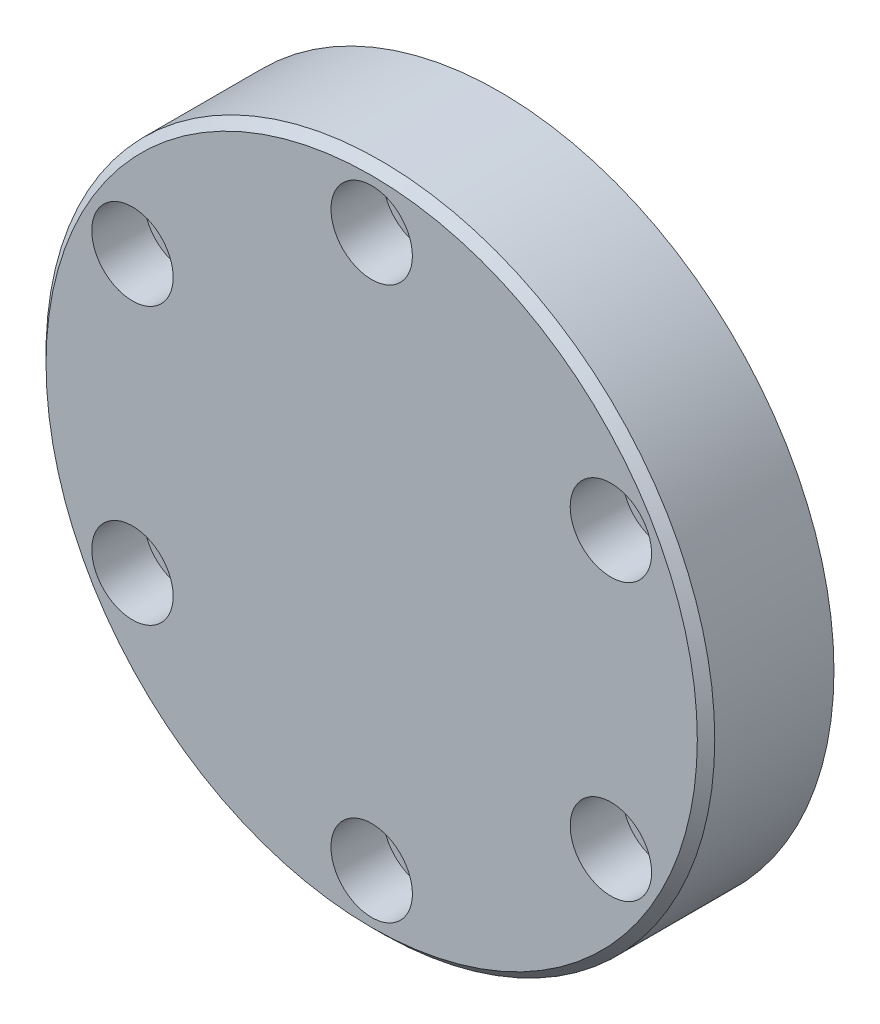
ISO-10303-21;
HEADER;
FILE_DESCRIPTION(('STEP AP214'),'2;1');
FILE_NAME('part.step','',(''),(''),'','','');
FILE_SCHEMA(('AUTOMOTIVE_DESIGN { 1 0 10303 214 1 1 1 1 }'));
ENDSEC;
DATA;
#1=APPLICATION_CONTEXT('core data for automotive mechanical design processes');
#2=APPLICATION_PROTOCOL_DEFINITION('international standard','automotive_design',2000,#1);
#3=PRODUCT_CONTEXT('',#1,'mechanical');
#4=PRODUCT('Part','Part','',(#3));
#5=PRODUCT_RELATED_PRODUCT_CATEGORY('part','',(#4));
#6=PRODUCT_DEFINITION_FORMATION('','',#4);
#7=PRODUCT_DEFINITION_CONTEXT('part definition',#1,'design');
#8=PRODUCT_DEFINITION('design','',#6,#7);
#9=PRODUCT_DEFINITION_SHAPE('','',#8);
#10=(LENGTH_UNIT() NAMED_UNIT(*) SI_UNIT(.MILLI.,.METRE.));
#11=(NAMED_UNIT(*) PLANE_ANGLE_UNIT() SI_UNIT($,.RADIAN.));
#12=(NAMED_UNIT(*) SI_UNIT($,.STERADIAN.) SOLID_ANGLE_UNIT());
#13=UNCERTAINTY_MEASURE_WITH_UNIT(LENGTH_MEASURE(1.E-05),#10,'distance_accuracy_value','');
#14=(GEOMETRIC_REPRESENTATION_CONTEXT(3) GLOBAL_UNCERTAINTY_ASSIGNED_CONTEXT((#13)) GLOBAL_UNIT_ASSIGNED_CONTEXT((#10,
#11,#12)) REPRESENTATION_CONTEXT('',''));
#15=CARTESIAN_POINT('',(0.,0.,0.));
#16=DIRECTION('',(0.,0.,1.));
#17=DIRECTION('',(1.,0.,0.));
#18=AXIS2_PLACEMENT_3D('',#15,#16,#17);
#19=CARTESIAN_POINT('',(0.,0.,-11.));
#20=DIRECTION('',(0.,0.,1.));
#21=DIRECTION('',(1.,0.,0.));
#22=AXIS2_PLACEMENT_3D('',#19,#20,#21);
#23=PLANE('',#22);
#24=CARTESIAN_POINT('',(0.,0.,-11.));
#25=DIRECTION('',(0.,0.,1.));
#26=DIRECTION('',(1.,0.,0.));
#27=AXIS2_PLACEMENT_3D('',#24,#25,#26);
#28=CIRCLE('',#27,57.5);
#29=CARTESIAN_POINT('',(57.5,0.,-11.));
#30=VERTEX_POINT('',#29);
#31=EDGE_CURVE('E284',#30,#30,#28,.T.);
#32=ORIENTED_EDGE('',*,*,#31,.F.);
#33=EDGE_LOOP('',(#32));
#34=FACE_BOUND('',#33,.T.);
#35=CARTESIAN_POINT('',(0.,0.,-11.));
#36=DIRECTION('',(0.,0.,-1.));
#37=DIRECTION('',(-1.,0.,0.));
#38=AXIS2_PLACEMENT_3D('',#35,#36,#37);
#39=CIRCLE('',#38,32.5);
#40=CARTESIAN_POINT('',(-32.3115384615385,3.49492235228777,-11.));
#41=VERTEX_POINT('',#40);
#42=CARTESIAN_POINT('',(-32.3115384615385,-3.49492235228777,-11.));
#43=VERTEX_POINT('',#42);
#44=EDGE_CURVE('E372',#41,#43,#39,.T.);
#45=ORIENTED_EDGE('',*,*,#44,.F.);
#46=CARTESIAN_POINT('',(-32.5,0.,-11.));
#47=DIRECTION('',(0.,0.,-1.));
#48=DIRECTION('',(-1.,0.,0.));
#49=AXIS2_PLACEMENT_3D('',#46,#47,#48);
#50=CIRCLE('',#49,3.5);
#51=EDGE_CURVE('E83',#43,#41,#50,.T.);
#52=ORIENTED_EDGE('',*,*,#51,.F.);
#53=EDGE_LOOP('',(#45,#52));
#54=FACE_BOUND('',#53,.T.);
#55=CARTESIAN_POINT('',(0.,47.5,-11.));
#56=DIRECTION('',(0.,0.,1.));
#57=DIRECTION('',(1.,0.,0.));
#58=AXIS2_PLACEMENT_3D('',#55,#56,#57);
#59=CIRCLE('',#58,4.5);
#60=CARTESIAN_POINT('',(4.5,47.5,-11.));
#61=VERTEX_POINT('',#60);
#62=EDGE_CURVE('E297',#61,#61,#59,.T.);
#63=ORIENTED_EDGE('',*,*,#62,.T.);
#64=EDGE_LOOP('',(#63));
#65=FACE_BOUND('',#64,.T.);
#66=CARTESIAN_POINT('',(41.1362066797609,23.7499999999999,-11.));
#67=DIRECTION('',(0.,0.,1.));
#68=DIRECTION('',(0.499999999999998,-0.86602540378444,0.));
#69=AXIS2_PLACEMENT_3D('',#66,#67,#68);
#70=CIRCLE('',#69,4.5);
#71=CARTESIAN_POINT('',(43.3862066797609,19.8528856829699,-11.));
#72=VERTEX_POINT('',#71);
#73=EDGE_CURVE('E364',#72,#72,#70,.T.);
#74=ORIENTED_EDGE('',*,*,#73,.T.);
#75=EDGE_LOOP('',(#74));
#76=FACE_BOUND('',#75,.T.);
#77=CARTESIAN_POINT('',(41.1362066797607,-23.7500000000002,-11.));
#78=DIRECTION('',(0.,0.,1.));
#79=DIRECTION('',(-0.500000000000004,-0.866025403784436,0.));
#80=AXIS2_PLACEMENT_3D('',#77,#78,#79);
#81=CIRCLE('',#80,4.5);
#82=CARTESIAN_POINT('',(38.8862066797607,-27.6471143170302,-11.));
#83=VERTEX_POINT('',#82);
#84=EDGE_CURVE('E361',#83,#83,#81,.T.);
#85=ORIENTED_EDGE('',*,*,#84,.T.);
#86=EDGE_LOOP('',(#85));
#87=FACE_BOUND('',#86,.T.);
#88=CARTESIAN_POINT('',(-3.31690919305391E-13,-47.5,-11.));
#89=DIRECTION('',(0.,0.,1.));
#90=DIRECTION('',(-1.,0.,0.));
#91=AXIS2_PLACEMENT_3D('',#88,#89,#90);
#92=CIRCLE('',#91,4.5);
#93=CARTESIAN_POINT('',(-4.50000000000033,-47.5,-11.));
#94=VERTEX_POINT('',#93);
#95=EDGE_CURVE('E358',#94,#94,#92,.T.);
#96=ORIENTED_EDGE('',*,*,#95,.T.);
#97=EDGE_LOOP('',(#96));
#98=FACE_BOUND('',#97,.T.);
#99=CARTESIAN_POINT('',(-41.1362066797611,-23.7499999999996,-11.));
#100=DIRECTION('',(0.,0.,1.));
#101=DIRECTION('',(-0.499999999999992,0.866025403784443,0.));
#102=AXIS2_PLACEMENT_3D('',#99,#100,#101);
#103=CIRCLE('',#102,4.5);
#104=CARTESIAN_POINT('',(-43.386206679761,-19.8528856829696,-11.));
#105=VERTEX_POINT('',#104);
#106=EDGE_CURVE('E355',#105,#105,#103,.T.);
#107=ORIENTED_EDGE('',*,*,#106,.T.);
#108=EDGE_LOOP('',(#107));
#109=FACE_BOUND('',#108,.T.);
#110=CARTESIAN_POINT('',(-41.1362066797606,23.7500000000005,-11.));
#111=DIRECTION('',(0.,0.,1.));
#112=DIRECTION('',(0.50000000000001,0.866025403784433,0.));
#113=AXIS2_PLACEMENT_3D('',#110,#111,#112);
#114=CIRCLE('',#113,4.5);
#115=CARTESIAN_POINT('',(-38.8862066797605,27.6471143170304,-11.));
#116=VERTEX_POINT('',#115);
#117=EDGE_CURVE('E302',#116,#116,#114,.T.);
#118=ORIENTED_EDGE('',*,*,#117,.T.);
#119=EDGE_LOOP('',(#118));
#120=FACE_BOUND('',#119,.T.);
#121=CARTESIAN_POINT('',(47.5,0.,-11.));
#122=DIRECTION('',(0.,0.,1.));
#123=DIRECTION('',(1.,0.,0.));
#124=AXIS2_PLACEMENT_3D('',#121,#122,#123);
#125=CIRCLE('',#124,3.5);
#126=CARTESIAN_POINT('',(51.,0.,-11.));
#127=VERTEX_POINT('',#126);
#128=EDGE_CURVE('E80',#127,#127,#125,.T.);
#129=ORIENTED_EDGE('',*,*,#128,.T.);
#130=EDGE_LOOP('',(#129));
#131=FACE_BOUND('',#130,.T.);
#132=ADVANCED_FACE('F31',(#34,#54,#65,#76,#87,#98,#109,#120,#131),#23,.F.);
#133=CARTESIAN_POINT('',(-57.5,0.,0.));
#134=DIRECTION('',(-1.,0.,0.));
#135=DIRECTION('',(0.,0.,1.));
#136=AXIS2_PLACEMENT_3D('',#133,#134,#135);
#137=CYLINDRICAL_SURFACE('',#136,3.5);
#138=CARTESIAN_POINT('',(-17.5,0.,0.));
#139=DIRECTION('',(-1.,0.,0.));
#140=DIRECTION('',(0.,0.,1.));
#141=AXIS2_PLACEMENT_3D('',#138,#139,#140);
#142=CIRCLE('',#141,3.5);
#143=CARTESIAN_POINT('',(-17.5,0.,3.5));
#144=VERTEX_POINT('',#143);
#145=EDGE_CURVE('E335',#144,#144,#142,.T.);
#146=ORIENTED_EDGE('',*,*,#145,.T.);
#147=EDGE_LOOP('',(#146));
#148=FACE_BOUND('',#147,.T.);
#149=CARTESIAN_POINT('',(47.5,0.,0.));
#150=DIRECTION('',(-0.707106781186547,0.,-0.707106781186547));
#151=DIRECTION('',(-0.707106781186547,0.,0.707106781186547));
#152=AXIS2_PLACEMENT_3D('',#149,#150,#151);
#153=ELLIPSE('',#152,4.94974746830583,3.5);
#154=CARTESIAN_POINT('',(47.5,3.5,0.));
#155=VERTEX_POINT('',#154);
#156=CARTESIAN_POINT('',(47.5,-3.5,0.));
#157=VERTEX_POINT('',#156);
#158=EDGE_CURVE('E287',#155,#157,#153,.F.);
#159=ORIENTED_EDGE('',*,*,#158,.T.);
#160=CARTESIAN_POINT('',(47.5,0.,0.));
#161=DIRECTION('',(-0.707106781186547,0.,0.707106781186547));
#162=DIRECTION('',(-0.707106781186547,0.,-0.707106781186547));
#163=AXIS2_PLACEMENT_3D('',#160,#161,#162);
#164=ELLIPSE('',#163,4.94974746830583,3.5);
#165=EDGE_CURVE('E48',#157,#155,#164,.F.);
#166=ORIENTED_EDGE('',*,*,#165,.T.);
#167=EDGE_LOOP('',(#159,#166));
#168=FACE_BOUND('',#167,.T.);
#169=ADVANCED_FACE('F161',(#148,#168),#137,.F.);
#170=CARTESIAN_POINT('',(0.,0.,11.));
#171=DIRECTION('',(0.,0.,-1.));
#172=DIRECTION('',(-1.,0.,0.));
#173=AXIS2_PLACEMENT_3D('',#170,#171,#172);
#174=CYLINDRICAL_SURFACE('',#173,57.5);
#175=CARTESIAN_POINT('',(-57.2474826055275,-5.38291141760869,-5.2050063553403));
#176=CARTESIAN_POINT('',(-57.1150260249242,-6.7658831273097,-3.81525270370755));
#177=CARTESIAN_POINT('',(-57.0011047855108,-7.55746430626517,-1.87907278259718));
#178=CARTESIAN_POINT('',(-57.0057413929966,-7.52361736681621,2.01643145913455));
#179=CARTESIAN_POINT('',(-57.1238286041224,-6.69604022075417,3.93453869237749));
#180=CARTESIAN_POINT('',(-57.3886317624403,-3.88207023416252,6.66076177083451));
#181=CARTESIAN_POINT('',(-57.5023374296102,-1.91715296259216,7.44977006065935));
#182=CARTESIAN_POINT('',(-57.4975872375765,2.04878328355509,7.41433431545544));
#183=CARTESIAN_POINT('',(-57.3805441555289,3.99403788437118,6.60047652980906));
#184=CARTESIAN_POINT('',(-57.114345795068,6.77258531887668,3.80873204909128));
#185=CARTESIAN_POINT('',(-57.0008917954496,7.55920417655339,1.87942957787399));
#186=CARTESIAN_POINT('',(-57.00595993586,7.52183551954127,-2.02119472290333));
#187=CARTESIAN_POINT('',(-57.1243489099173,6.69011832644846,-3.93944057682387));
#188=CARTESIAN_POINT('',(-57.3891769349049,3.87645153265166,-6.66704049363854));
#189=CARTESIAN_POINT('',(-57.5025134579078,1.9113678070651,-7.45107320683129));
#190=CARTESIAN_POINT('',(-57.4974042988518,-2.04890303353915,-7.41297923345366));
#191=CARTESIAN_POINT('',(-57.3799391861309,-3.99993970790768,-6.59476000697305));
#192=CARTESIAN_POINT('',(-57.2474826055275,-5.38291141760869,-5.2050063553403));
#193=B_SPLINE_CURVE_WITH_KNOTS('',3,(#175,#176,#177,#178,#179,#180,#181,#182,#183,#184,#185,
#186,#187,#188,#189,#190,#191,#192),.UNSPECIFIED.,.T.,.F.,(4,2,2,2,2,2,2,2,4),
(-0.0464215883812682,-0.0406131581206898,-0.0348047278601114,-0.028996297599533,
-0.0231878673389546,-0.0173794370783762,-0.0115710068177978,-0.00576257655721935,
4.585370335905E-05),.UNSPECIFIED.);
#194=CARTESIAN_POINT('',(-57.2474826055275,-5.38291141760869,-5.2050063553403));
#195=VERTEX_POINT('',#194);
#196=EDGE_CURVE('E11',#195,#195,#193,.F.);
#197=ORIENTED_EDGE('',*,*,#196,.T.);
#198=EDGE_LOOP('',(#197));
#199=FACE_BOUND('',#198,.T.);
#200=CARTESIAN_POINT('',(0.,0.,9.5));
#201=DIRECTION('',(0.,0.,1.));
#202=DIRECTION('',(1.,0.,0.));
#203=AXIS2_PLACEMENT_3D('',#200,#201,#202);
#204=CIRCLE('',#203,57.5);
#205=CARTESIAN_POINT('',(57.5,0.,9.5));
#206=VERTEX_POINT('',#205);
#207=EDGE_CURVE('E283',#206,#206,#204,.F.);
#208=ORIENTED_EDGE('',*,*,#207,.T.);
#209=EDGE_LOOP('',(#208));
#210=FACE_BOUND('',#209,.T.);
#211=ORIENTED_EDGE('',*,*,#31,.T.);
#212=EDGE_LOOP('',(#211));
#213=FACE_BOUND('',#212,.T.);
#214=ADVANCED_FACE('F33',(#199,#210,#213),#174,.T.);
#215=CARTESIAN_POINT('',(-41.1362066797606,23.7500000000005,-11.));
#216=DIRECTION('',(0.,0.,1.));
#217=DIRECTION('',(1.,0.,0.));
#218=AXIS2_PLACEMENT_3D('',#215,#216,#217);
#219=CYLINDRICAL_SURFACE('',#218,4.5);
#220=ORIENTED_EDGE('',*,*,#117,.F.);
#221=EDGE_LOOP('',(#220));
#222=FACE_BOUND('',#221,.T.);
#223=CARTESIAN_POINT('',(-41.1362066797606,23.7500000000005,2.));
#224=DIRECTION('',(0.,0.,1.));
#225=DIRECTION('',(1.,0.,0.));
#226=AXIS2_PLACEMENT_3D('',#223,#224,#225);
#227=CIRCLE('',#226,4.5);
#228=CARTESIAN_POINT('',(-36.6362066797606,23.7500000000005,2.));
#229=VERTEX_POINT('',#228);
#230=EDGE_CURVE('E316',#229,#229,#227,.F.);
#231=ORIENTED_EDGE('',*,*,#230,.F.);
#232=EDGE_LOOP('',(#231));
#233=FACE_BOUND('',#232,.T.);
#234=ADVANCED_FACE('F205',(#222,#233),#219,.F.);
#235=CARTESIAN_POINT('',(-41.1362066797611,-23.7499999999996,-11.));
#236=DIRECTION('',(0.,0.,1.));
#237=DIRECTION('',(1.,0.,0.));
#238=AXIS2_PLACEMENT_3D('',#235,#236,#237);
#239=CYLINDRICAL_SURFACE('',#238,4.5);
#240=ORIENTED_EDGE('',*,*,#106,.F.);
#241=EDGE_LOOP('',(#240));
#242=FACE_BOUND('',#241,.T.);
#243=CARTESIAN_POINT('',(-41.1362066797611,-23.7499999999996,2.));
#244=DIRECTION('',(0.,0.,1.));
#245=DIRECTION('',(1.,0.,0.));
#246=AXIS2_PLACEMENT_3D('',#243,#244,#245);
#247=CIRCLE('',#246,4.5);
#248=CARTESIAN_POINT('',(-36.6362066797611,-23.7499999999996,2.));
#249=VERTEX_POINT('',#248);
#250=EDGE_CURVE('E312',#249,#249,#247,.F.);
#251=ORIENTED_EDGE('',*,*,#250,.F.);
#252=EDGE_LOOP('',(#251));
#253=FACE_BOUND('',#252,.T.);
#254=ADVANCED_FACE('F208',(#242,#253),#239,.F.);
#255=CARTESIAN_POINT('',(-3.31690919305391E-13,-47.5,-11.));
#256=DIRECTION('',(0.,0.,1.));
#257=DIRECTION('',(1.,0.,0.));
#258=AXIS2_PLACEMENT_3D('',#255,#256,#257);
#259=CYLINDRICAL_SURFACE('',#258,4.5);
#260=ORIENTED_EDGE('',*,*,#95,.F.);
#261=EDGE_LOOP('',(#260));
#262=FACE_BOUND('',#261,.T.);
#263=CARTESIAN_POINT('',(-3.31690919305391E-13,-47.5,2.));
#264=DIRECTION('',(0.,0.,1.));
#265=DIRECTION('',(1.,0.,0.));
#266=AXIS2_PLACEMENT_3D('',#263,#264,#265);
#267=CIRCLE('',#266,4.5);
#268=CARTESIAN_POINT('',(4.49999999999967,-47.5,2.));
#269=VERTEX_POINT('',#268);
#270=EDGE_CURVE('E308',#269,#269,#267,.F.);
#271=ORIENTED_EDGE('',*,*,#270,.F.);
#272=EDGE_LOOP('',(#271));
#273=FACE_BOUND('',#272,.T.);
#274=ADVANCED_FACE('F212',(#262,#273),#259,.F.);
#275=CARTESIAN_POINT('',(41.1362066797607,-23.7500000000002,-11.));
#276=DIRECTION('',(0.,0.,1.));
#277=DIRECTION('',(1.,0.,0.));
#278=AXIS2_PLACEMENT_3D('',#275,#276,#277);
#279=CYLINDRICAL_SURFACE('',#278,4.5);
#280=ORIENTED_EDGE('',*,*,#84,.F.);
#281=EDGE_LOOP('',(#280));
#282=FACE_BOUND('',#281,.T.);
#283=CARTESIAN_POINT('',(41.1362066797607,-23.7500000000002,2.));
#284=DIRECTION('',(0.,0.,1.));
#285=DIRECTION('',(1.,0.,0.));
#286=AXIS2_PLACEMENT_3D('',#283,#284,#285);
#287=CIRCLE('',#286,4.5);
#288=CARTESIAN_POINT('',(45.6362066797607,-23.7500000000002,2.));
#289=VERTEX_POINT('',#288);
#290=EDGE_CURVE('E304',#289,#289,#287,.F.);
#291=ORIENTED_EDGE('',*,*,#290,.F.);
#292=EDGE_LOOP('',(#291));
#293=FACE_BOUND('',#292,.T.);
#294=ADVANCED_FACE('F216',(#282,#293),#279,.F.);
#295=CARTESIAN_POINT('',(41.1362066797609,23.7499999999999,-11.));
#296=DIRECTION('',(0.,0.,1.));
#297=DIRECTION('',(1.,0.,0.));
#298=AXIS2_PLACEMENT_3D('',#295,#296,#297);
#299=CYLINDRICAL_SURFACE('',#298,4.5);
#300=ORIENTED_EDGE('',*,*,#73,.F.);
#301=EDGE_LOOP('',(#300));
#302=FACE_BOUND('',#301,.T.);
#303=CARTESIAN_POINT('',(41.1362066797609,23.7499999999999,2.));
#304=DIRECTION('',(0.,0.,1.));
#305=DIRECTION('',(1.,0.,0.));
#306=AXIS2_PLACEMENT_3D('',#303,#304,#305);
#307=CIRCLE('',#306,4.5);
#308=CARTESIAN_POINT('',(45.6362066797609,23.7499999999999,2.));
#309=VERTEX_POINT('',#308);
#310=EDGE_CURVE('E299',#309,#309,#307,.F.);
#311=ORIENTED_EDGE('',*,*,#310,.F.);
#312=EDGE_LOOP('',(#311));
#313=FACE_BOUND('',#312,.T.);
#314=ADVANCED_FACE('F220',(#302,#313),#299,.F.);
#315=CARTESIAN_POINT('',(0.,47.5,-11.));
#316=DIRECTION('',(0.,0.,1.));
#317=DIRECTION('',(1.,0.,0.));
#318=AXIS2_PLACEMENT_3D('',#315,#316,#317);
#319=CYLINDRICAL_SURFACE('',#318,4.5);
#320=ORIENTED_EDGE('',*,*,#62,.F.);
#321=EDGE_LOOP('',(#320));
#322=FACE_BOUND('',#321,.T.);
#323=CARTESIAN_POINT('',(0.,47.5,2.));
#324=DIRECTION('',(0.,0.,1.));
#325=DIRECTION('',(1.,0.,0.));
#326=AXIS2_PLACEMENT_3D('',#323,#324,#325);
#327=CIRCLE('',#326,4.5);
#328=CARTESIAN_POINT('',(4.5,47.5,2.));
#329=VERTEX_POINT('',#328);
#330=EDGE_CURVE('E294',#329,#329,#327,.F.);
#331=ORIENTED_EDGE('',*,*,#330,.F.);
#332=EDGE_LOOP('',(#331));
#333=FACE_BOUND('',#332,.T.);
#334=ADVANCED_FACE('F224',(#322,#333),#319,.F.);
#335=CARTESIAN_POINT('',(0.,0.,11.));
#336=DIRECTION('',(0.,0.,1.));
#337=DIRECTION('',(1.,0.,0.));
#338=AXIS2_PLACEMENT_3D('',#335,#336,#337);
#339=PLANE('',#338);
#340=CARTESIAN_POINT('',(-41.1362066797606,23.7500000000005,11.));
#341=DIRECTION('',(0.,0.,1.));
#342=DIRECTION('',(0.50000000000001,0.866025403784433,0.));
#343=AXIS2_PLACEMENT_3D('',#340,#341,#342);
#344=CIRCLE('',#343,7.);
#345=CARTESIAN_POINT('',(-37.6362066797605,29.8121778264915,11.));
#346=VERTEX_POINT('',#345);
#347=EDGE_CURVE('E258',#346,#346,#344,.T.);
#348=ORIENTED_EDGE('',*,*,#347,.F.);
#349=EDGE_LOOP('',(#348));
#350=FACE_BOUND('',#349,.T.);
#351=CARTESIAN_POINT('',(-41.1362066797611,-23.7499999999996,11.));
#352=DIRECTION('',(0.,0.,1.));
#353=DIRECTION('',(-0.499999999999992,0.866025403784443,0.));
#354=AXIS2_PLACEMENT_3D('',#351,#352,#353);
#355=CIRCLE('',#354,7.);
#356=CARTESIAN_POINT('',(-44.636206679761,-17.6878221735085,11.));
#357=VERTEX_POINT('',#356);
#358=EDGE_CURVE('E262',#357,#357,#355,.T.);
#359=ORIENTED_EDGE('',*,*,#358,.F.);
#360=EDGE_LOOP('',(#359));
#361=FACE_BOUND('',#360,.T.);
#362=CARTESIAN_POINT('',(-3.31690919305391E-13,-47.5,11.));
#363=DIRECTION('',(0.,0.,1.));
#364=DIRECTION('',(-1.,0.,0.));
#365=AXIS2_PLACEMENT_3D('',#362,#363,#364);
#366=CIRCLE('',#365,7.);
#367=CARTESIAN_POINT('',(-7.00000000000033,-47.5,11.));
#368=VERTEX_POINT('',#367);
#369=EDGE_CURVE('E266',#368,#368,#366,.T.);
#370=ORIENTED_EDGE('',*,*,#369,.F.);
#371=EDGE_LOOP('',(#370));
#372=FACE_BOUND('',#371,.T.);
#373=CARTESIAN_POINT('',(41.1362066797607,-23.7500000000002,11.));
#374=DIRECTION('',(0.,0.,1.));
#375=DIRECTION('',(-0.500000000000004,-0.866025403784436,0.));
#376=AXIS2_PLACEMENT_3D('',#373,#374,#375);
#377=CIRCLE('',#376,7.);
#378=CARTESIAN_POINT('',(37.6362066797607,-29.8121778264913,11.));
#379=VERTEX_POINT('',#378);
#380=EDGE_CURVE('E270',#379,#379,#377,.T.);
#381=ORIENTED_EDGE('',*,*,#380,.F.);
#382=EDGE_LOOP('',(#381));
#383=FACE_BOUND('',#382,.T.);
#384=CARTESIAN_POINT('',(41.1362066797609,23.7499999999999,11.));
#385=DIRECTION('',(0.,0.,1.));
#386=DIRECTION('',(0.499999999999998,-0.86602540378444,0.));
#387=AXIS2_PLACEMENT_3D('',#384,#385,#386);
#388=CIRCLE('',#387,7.);
#389=CARTESIAN_POINT('',(44.6362066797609,17.6878221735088,11.));
#390=VERTEX_POINT('',#389);
#391=EDGE_CURVE('E274',#390,#390,#388,.T.);
#392=ORIENTED_EDGE('',*,*,#391,.F.);
#393=EDGE_LOOP('',(#392));
#394=FACE_BOUND('',#393,.T.);
#395=CARTESIAN_POINT('',(0.,47.5,11.));
#396=DIRECTION('',(0.,0.,1.));
#397=DIRECTION('',(1.,0.,0.));
#398=AXIS2_PLACEMENT_3D('',#395,#396,#397);
#399=CIRCLE('',#398,7.);
#400=CARTESIAN_POINT('',(7.,47.5,11.));
#401=VERTEX_POINT('',#400);
#402=EDGE_CURVE('E278',#401,#401,#399,.T.);
#403=ORIENTED_EDGE('',*,*,#402,.F.);
#404=EDGE_LOOP('',(#403));
#405=FACE_BOUND('',#404,.T.);
#406=CARTESIAN_POINT('',(0.,0.,11.));
#407=DIRECTION('',(0.,0.,1.));
#408=DIRECTION('',(1.,0.,0.));
#409=AXIS2_PLACEMENT_3D('',#406,#407,#408);
#410=CIRCLE('',#409,56.);
#411=CARTESIAN_POINT('',(56.,0.,11.));
#412=VERTEX_POINT('',#411);
#413=EDGE_CURVE('E281',#412,#412,#410,.T.);
#414=ORIENTED_EDGE('',*,*,#413,.T.);
#415=EDGE_LOOP('',(#414));
#416=FACE_BOUND('',#415,.T.);
#417=ADVANCED_FACE('F236',(#350,#361,#372,#383,#394,#405,#416),#339,.T.);
#418=CARTESIAN_POINT('',(0.,0.,11.));
#419=DIRECTION('',(0.,0.,-1.));
#420=DIRECTION('',(-1.,0.,0.));
#421=AXIS2_PLACEMENT_3D('',#418,#419,#420);
#422=CONICAL_SURFACE('',#421,56.,0.785398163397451);
#423=ORIENTED_EDGE('',*,*,#207,.F.);
#424=EDGE_LOOP('',(#423));
#425=FACE_BOUND('',#424,.T.);
#426=ORIENTED_EDGE('',*,*,#413,.F.);
#427=EDGE_LOOP('',(#426));
#428=FACE_BOUND('',#427,.T.);
#429=ADVANCED_FACE('F244',(#425,#428),#422,.T.);
#430=CARTESIAN_POINT('',(0.,0.,-10.));
#431=DIRECTION('',(0.,0.,-1.));
#432=DIRECTION('',(-1.,0.,0.));
#433=AXIS2_PLACEMENT_3D('',#430,#431,#432);
#434=CYLINDRICAL_SURFACE('',#433,32.5);
#435=CARTESIAN_POINT('',(0.,0.,-10.));
#436=DIRECTION('',(0.,0.,-1.));
#437=DIRECTION('',(-1.,0.,0.));
#438=AXIS2_PLACEMENT_3D('',#435,#436,#437);
#439=CIRCLE('',#438,32.5);
#440=CARTESIAN_POINT('',(-32.3115384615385,3.49492235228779,-10.));
#441=VERTEX_POINT('',#440);
#442=CARTESIAN_POINT('',(-32.3115384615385,-3.49492235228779,-10.));
#443=VERTEX_POINT('',#442);
#444=EDGE_CURVE('E290',#441,#443,#439,.T.);
#445=ORIENTED_EDGE('',*,*,#444,.F.);
#446=DIRECTION('',(0.,0.,-1.));
#447=VECTOR('',#446,1.);
#448=CARTESIAN_POINT('',(-32.3115384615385,3.49492235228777,-7.25675682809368));
#449=LINE('',#448,#447);
#450=EDGE_CURVE('E56',#441,#41,#449,.T.);
#451=ORIENTED_EDGE('',*,*,#450,.T.);
#452=ORIENTED_EDGE('',*,*,#44,.T.);
#453=DIRECTION('',(0.,0.,-1.));
#454=VECTOR('',#453,1.);
#455=CARTESIAN_POINT('',(-32.3115384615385,-3.49492235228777,-7.25675682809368));
#456=LINE('',#455,#454);
#457=EDGE_CURVE('E330',#43,#443,#456,.F.);
#458=ORIENTED_EDGE('',*,*,#457,.T.);
#459=EDGE_LOOP('',(#445,#451,#452,#458));
#460=FACE_BOUND('',#459,.T.);
#461=ADVANCED_FACE('F240',(#460),#434,.F.);
#462=CARTESIAN_POINT('',(0.,0.,-10.));
#463=DIRECTION('',(0.,0.,-1.));
#464=DIRECTION('',(-1.,0.,0.));
#465=AXIS2_PLACEMENT_3D('',#462,#463,#464);
#466=PLANE('',#465);
#467=CARTESIAN_POINT('',(-32.5,0.,-10.));
#468=DIRECTION('',(0.,0.,-1.));
#469=DIRECTION('',(-1.,0.,0.));
#470=AXIS2_PLACEMENT_3D('',#467,#468,#469);
#471=CIRCLE('',#470,3.5);
#472=EDGE_CURVE('E99',#441,#443,#471,.T.);
#473=ORIENTED_EDGE('',*,*,#472,.F.);
#474=ORIENTED_EDGE('',*,*,#444,.T.);
#475=EDGE_LOOP('',(#473,#474));
#476=FACE_BOUND('',#475,.T.);
#477=ADVANCED_FACE('F229',(#476),#466,.T.);
#478=CARTESIAN_POINT('',(0.,47.5,2.));
#479=DIRECTION('',(0.,0.,1.));
#480=DIRECTION('',(1.,0.,0.));
#481=AXIS2_PLACEMENT_3D('',#478,#479,#480);
#482=PLANE('',#481);
#483=CARTESIAN_POINT('',(0.,47.5,2.));
#484=DIRECTION('',(0.,0.,1.));
#485=DIRECTION('',(1.,0.,0.));
#486=AXIS2_PLACEMENT_3D('',#483,#484,#485);
#487=CIRCLE('',#486,7.);
#488=CARTESIAN_POINT('',(7.,47.5,2.));
#489=VERTEX_POINT('',#488);
#490=EDGE_CURVE('E298',#489,#489,#487,.T.);
#491=ORIENTED_EDGE('',*,*,#490,.T.);
#492=EDGE_LOOP('',(#491));
#493=FACE_BOUND('',#492,.T.);
#494=ORIENTED_EDGE('',*,*,#330,.T.);
#495=EDGE_LOOP('',(#494));
#496=FACE_BOUND('',#495,.T.);
#497=ADVANCED_FACE('F226',(#493,#496),#482,.T.);
#498=CARTESIAN_POINT('',(0.,47.5,2.));
#499=DIRECTION('',(0.,0.,1.));
#500=DIRECTION('',(1.,0.,0.));
#501=AXIS2_PLACEMENT_3D('',#498,#499,#500);
#502=CYLINDRICAL_SURFACE('',#501,7.);
#503=ORIENTED_EDGE('',*,*,#490,.F.);
#504=EDGE_LOOP('',(#503));
#505=FACE_BOUND('',#504,.T.);
#506=ORIENTED_EDGE('',*,*,#402,.T.);
#507=EDGE_LOOP('',(#506));
#508=FACE_BOUND('',#507,.T.);
#509=ADVANCED_FACE('F200',(#505,#508),#502,.F.);
#510=CARTESIAN_POINT('',(41.1362066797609,23.7499999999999,2.));
#511=DIRECTION('',(0.,0.,1.));
#512=DIRECTION('',(0.499999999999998,-0.86602540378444,0.));
#513=AXIS2_PLACEMENT_3D('',#510,#511,#512);
#514=PLANE('',#513);
#515=CARTESIAN_POINT('',(41.1362066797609,23.7499999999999,2.));
#516=DIRECTION('',(0.,0.,1.));
#517=DIRECTION('',(0.499999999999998,-0.86602540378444,0.));
#518=AXIS2_PLACEMENT_3D('',#515,#516,#517);
#519=CIRCLE('',#518,7.);
#520=CARTESIAN_POINT('',(44.6362066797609,17.6878221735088,2.));
#521=VERTEX_POINT('',#520);
#522=EDGE_CURVE('E303',#521,#521,#519,.T.);
#523=ORIENTED_EDGE('',*,*,#522,.T.);
#524=EDGE_LOOP('',(#523));
#525=FACE_BOUND('',#524,.T.);
#526=ORIENTED_EDGE('',*,*,#310,.T.);
#527=EDGE_LOOP('',(#526));
#528=FACE_BOUND('',#527,.T.);
#529=ADVANCED_FACE('F197',(#525,#528),#514,.T.);
#530=CARTESIAN_POINT('',(41.1362066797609,23.7499999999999,2.));
#531=DIRECTION('',(0.,0.,1.));
#532=DIRECTION('',(1.,0.,0.));
#533=AXIS2_PLACEMENT_3D('',#530,#531,#532);
#534=CYLINDRICAL_SURFACE('',#533,7.);
#535=ORIENTED_EDGE('',*,*,#522,.F.);
#536=EDGE_LOOP('',(#535));
#537=FACE_BOUND('',#536,.T.);
#538=ORIENTED_EDGE('',*,*,#391,.T.);
#539=EDGE_LOOP('',(#538));
#540=FACE_BOUND('',#539,.T.);
#541=ADVANCED_FACE('F192',(#537,#540),#534,.F.);
#542=CARTESIAN_POINT('',(41.1362066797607,-23.7500000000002,2.));
#543=DIRECTION('',(0.,0.,1.));
#544=DIRECTION('',(-0.500000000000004,-0.866025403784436,0.));
#545=AXIS2_PLACEMENT_3D('',#542,#543,#544);
#546=PLANE('',#545);
#547=CARTESIAN_POINT('',(41.1362066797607,-23.7500000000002,2.));
#548=DIRECTION('',(0.,0.,1.));
#549=DIRECTION('',(-0.500000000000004,-0.866025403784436,0.));
#550=AXIS2_PLACEMENT_3D('',#547,#548,#549);
#551=CIRCLE('',#550,7.);
#552=CARTESIAN_POINT('',(37.6362066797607,-29.8121778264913,2.));
#553=VERTEX_POINT('',#552);
#554=EDGE_CURVE('E307',#553,#553,#551,.T.);
#555=ORIENTED_EDGE('',*,*,#554,.T.);
#556=EDGE_LOOP('',(#555));
#557=FACE_BOUND('',#556,.T.);
#558=ORIENTED_EDGE('',*,*,#290,.T.);
#559=EDGE_LOOP('',(#558));
#560=FACE_BOUND('',#559,.T.);
#561=ADVANCED_FACE('F189',(#557,#560),#546,.T.);
#562=CARTESIAN_POINT('',(41.1362066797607,-23.7500000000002,2.));
#563=DIRECTION('',(0.,0.,1.));
#564=DIRECTION('',(1.,0.,0.));
#565=AXIS2_PLACEMENT_3D('',#562,#563,#564);
#566=CYLINDRICAL_SURFACE('',#565,7.);
#567=ORIENTED_EDGE('',*,*,#554,.F.);
#568=EDGE_LOOP('',(#567));
#569=FACE_BOUND('',#568,.T.);
#570=ORIENTED_EDGE('',*,*,#380,.T.);
#571=EDGE_LOOP('',(#570));
#572=FACE_BOUND('',#571,.T.);
#573=ADVANCED_FACE('F184',(#569,#572),#566,.F.);
#574=CARTESIAN_POINT('',(-3.31690919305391E-13,-47.5,2.));
#575=DIRECTION('',(0.,0.,1.));
#576=DIRECTION('',(-1.,0.,0.));
#577=AXIS2_PLACEMENT_3D('',#574,#575,#576);
#578=PLANE('',#577);
#579=CARTESIAN_POINT('',(-3.31690919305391E-13,-47.5,2.));
#580=DIRECTION('',(0.,0.,1.));
#581=DIRECTION('',(-1.,0.,0.));
#582=AXIS2_PLACEMENT_3D('',#579,#580,#581);
#583=CIRCLE('',#582,7.);
#584=CARTESIAN_POINT('',(-7.00000000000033,-47.5,2.));
#585=VERTEX_POINT('',#584);
#586=EDGE_CURVE('E311',#585,#585,#583,.T.);
#587=ORIENTED_EDGE('',*,*,#586,.T.);
#588=EDGE_LOOP('',(#587));
#589=FACE_BOUND('',#588,.T.);
#590=ORIENTED_EDGE('',*,*,#270,.T.);
#591=EDGE_LOOP('',(#590));
#592=FACE_BOUND('',#591,.T.);
#593=ADVANCED_FACE('F181',(#589,#592),#578,.T.);
#594=CARTESIAN_POINT('',(-3.31690919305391E-13,-47.5,2.));
#595=DIRECTION('',(0.,0.,1.));
#596=DIRECTION('',(1.,0.,0.));
#597=AXIS2_PLACEMENT_3D('',#594,#595,#596);
#598=CYLINDRICAL_SURFACE('',#597,7.);
#599=ORIENTED_EDGE('',*,*,#586,.F.);
#600=EDGE_LOOP('',(#599));
#601=FACE_BOUND('',#600,.T.);
#602=ORIENTED_EDGE('',*,*,#369,.T.);
#603=EDGE_LOOP('',(#602));
#604=FACE_BOUND('',#603,.T.);
#605=ADVANCED_FACE('F176',(#601,#604),#598,.F.);
#606=CARTESIAN_POINT('',(-41.1362066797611,-23.7499999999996,2.));
#607=DIRECTION('',(0.,0.,1.));
#608=DIRECTION('',(-0.499999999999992,0.866025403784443,0.));
#609=AXIS2_PLACEMENT_3D('',#606,#607,#608);
#610=PLANE('',#609);
#611=CARTESIAN_POINT('',(-41.1362066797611,-23.7499999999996,2.));
#612=DIRECTION('',(0.,0.,1.));
#613=DIRECTION('',(-0.499999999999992,0.866025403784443,0.));
#614=AXIS2_PLACEMENT_3D('',#611,#612,#613);
#615=CIRCLE('',#614,7.);
#616=CARTESIAN_POINT('',(-44.636206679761,-17.6878221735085,2.));
#617=VERTEX_POINT('',#616);
#618=EDGE_CURVE('E315',#617,#617,#615,.T.);
#619=ORIENTED_EDGE('',*,*,#618,.T.);
#620=EDGE_LOOP('',(#619));
#621=FACE_BOUND('',#620,.T.);
#622=ORIENTED_EDGE('',*,*,#250,.T.);
#623=EDGE_LOOP('',(#622));
#624=FACE_BOUND('',#623,.T.);
#625=ADVANCED_FACE('F173',(#621,#624),#610,.T.);
#626=CARTESIAN_POINT('',(-41.1362066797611,-23.7499999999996,2.));
#627=DIRECTION('',(0.,0.,1.));
#628=DIRECTION('',(1.,0.,0.));
#629=AXIS2_PLACEMENT_3D('',#626,#627,#628);
#630=CYLINDRICAL_SURFACE('',#629,7.);
#631=ORIENTED_EDGE('',*,*,#618,.F.);
#632=EDGE_LOOP('',(#631));
#633=FACE_BOUND('',#632,.T.);
#634=ORIENTED_EDGE('',*,*,#358,.T.);
#635=EDGE_LOOP('',(#634));
#636=FACE_BOUND('',#635,.T.);
#637=ADVANCED_FACE('F168',(#633,#636),#630,.F.);
#638=CARTESIAN_POINT('',(-41.1362066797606,23.7500000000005,2.));
#639=DIRECTION('',(0.,0.,1.));
#640=DIRECTION('',(0.50000000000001,0.866025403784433,0.));
#641=AXIS2_PLACEMENT_3D('',#638,#639,#640);
#642=PLANE('',#641);
#643=CARTESIAN_POINT('',(-41.1362066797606,23.7500000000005,2.));
#644=DIRECTION('',(0.,0.,1.));
#645=DIRECTION('',(0.50000000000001,0.866025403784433,0.));
#646=AXIS2_PLACEMENT_3D('',#643,#644,#645);
#647=CIRCLE('',#646,7.);
#648=CARTESIAN_POINT('',(-37.6362066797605,29.8121778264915,2.));
#649=VERTEX_POINT('',#648);
#650=EDGE_CURVE('E319',#649,#649,#647,.T.);
#651=ORIENTED_EDGE('',*,*,#650,.T.);
#652=EDGE_LOOP('',(#651));
#653=FACE_BOUND('',#652,.T.);
#654=ORIENTED_EDGE('',*,*,#230,.T.);
#655=EDGE_LOOP('',(#654));
#656=FACE_BOUND('',#655,.T.);
#657=ADVANCED_FACE('F165',(#653,#656),#642,.T.);
#658=CARTESIAN_POINT('',(-41.1362066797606,23.7500000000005,2.));
#659=DIRECTION('',(0.,0.,1.));
#660=DIRECTION('',(1.,0.,0.));
#661=AXIS2_PLACEMENT_3D('',#658,#659,#660);
#662=CYLINDRICAL_SURFACE('',#661,7.);
#663=ORIENTED_EDGE('',*,*,#650,.F.);
#664=EDGE_LOOP('',(#663));
#665=FACE_BOUND('',#664,.T.);
#666=ORIENTED_EDGE('',*,*,#347,.T.);
#667=EDGE_LOOP('',(#666));
#668=FACE_BOUND('',#667,.T.);
#669=ADVANCED_FACE('F148',(#665,#668),#662,.F.);
#670=CARTESIAN_POINT('',(-42.5,0.,0.));
#671=DIRECTION('',(-1.,0.,0.));
#672=DIRECTION('',(0.,0.,1.));
#673=AXIS2_PLACEMENT_3D('',#670,#671,#672);
#674=CONICAL_SURFACE('',#673,6.03125,0.0312398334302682);
#675=CARTESIAN_POINT('',(-56.3377259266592,-4.60932009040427,-4.53136995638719));
#676=CARTESIAN_POINT('',(-56.3458644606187,-4.53536906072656,-4.6069750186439));
#677=CARTESIAN_POINT('',(-56.3539499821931,-4.45947495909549,-4.68067962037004));
#678=CARTESIAN_POINT('',(-56.3699576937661,-4.30410546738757,-4.82410294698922));
#679=CARTESIAN_POINT('',(-56.3778800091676,-4.22463298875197,-4.89382481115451));
#680=CARTESIAN_POINT('',(-56.3935131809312,-4.06233406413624,-5.02918439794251));
#681=CARTESIAN_POINT('',(-56.4012241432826,-3.9795093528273,-5.09482418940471));
#682=CARTESIAN_POINT('',(-56.4163867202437,-3.81073210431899,-5.2219243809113));
#683=CARTESIAN_POINT('',(-56.4238384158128,-3.72478056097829,-5.28338609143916));
#684=CARTESIAN_POINT('',(-56.438434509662,-3.54997555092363,-5.40203364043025));
#685=CARTESIAN_POINT('',(-56.4455789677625,-3.46112265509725,-5.45922031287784));
#686=CARTESIAN_POINT('',(-56.4595126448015,-3.28074050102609,-5.56922125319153));
#687=CARTESIAN_POINT('',(-56.4663019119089,-3.18921160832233,-5.62203611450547));
#688=CARTESIAN_POINT('',(-56.4794772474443,-3.0037028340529,-5.72319659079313));
#689=CARTESIAN_POINT('',(-56.4858633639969,-2.90972324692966,-5.77154273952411));
#690=CARTESIAN_POINT('',(-56.4981844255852,-2.71953833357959,-5.86366877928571));
#691=CARTESIAN_POINT('',(-56.5041194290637,-2.62333329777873,-5.90744926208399));
#692=CARTESIAN_POINT('',(-56.5154902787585,-2.42892268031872,-5.99034683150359));
#693=CARTESIAN_POINT('',(-56.5209261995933,-2.33071740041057,-6.02946461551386));
#694=CARTESIAN_POINT('',(-56.5312508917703,-2.13253147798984,-6.10293960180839));
#695=CARTESIAN_POINT('',(-56.5361397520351,-2.03255112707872,-6.13729757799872));
#696=CARTESIAN_POINT('',(-56.545322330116,-1.83104027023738,-6.20115578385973));
#697=CARTESIAN_POINT('',(-56.5496161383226,-1.72951000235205,-6.23065675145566));
#698=CARTESIAN_POINT('',(-56.5575606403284,-1.52512455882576,-6.28470391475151));
#699=CARTESIAN_POINT('',(-56.5612113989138,-1.42226951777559,-6.30925060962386));
#700=CARTESIAN_POINT('',(-56.5678218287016,-1.21545982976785,-6.35329230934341));
#701=CARTESIAN_POINT('',(-56.5707814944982,-1.11150517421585,-6.37278727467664));
#702=CARTESIAN_POINT('',(-56.5759619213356,-0.902721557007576,-6.4066292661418));
#703=CARTESIAN_POINT('',(-56.5781825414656,-0.797892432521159,-6.42097531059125));
#704=CARTESIAN_POINT('',(-56.5818367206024,-0.58758530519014,-6.44442225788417));
#705=CARTESIAN_POINT('',(-56.5832699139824,-0.482107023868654,-6.45352072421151));
#706=CARTESIAN_POINT('',(-56.5853026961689,-0.270726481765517,-6.46638092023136));
#707=CARTESIAN_POINT('',(-56.5859015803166,-0.164823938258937,-6.47013813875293));
#708=CARTESIAN_POINT('',(-56.5862134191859,0.0470287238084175,-6.47220440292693));
#709=CARTESIAN_POINT('',(-56.5859264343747,0.152978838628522,-6.47051382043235));
#710=CARTESIAN_POINT('',(-56.5845063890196,0.364546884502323,-6.46175119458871));
#711=CARTESIAN_POINT('',(-56.5833741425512,0.470165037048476,-6.4546843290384));
#712=CARTESIAN_POINT('',(-56.580311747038,0.680842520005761,-6.43527128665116));
#713=CARTESIAN_POINT('',(-56.5783820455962,0.78590213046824,-6.42292807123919));
#714=CARTESIAN_POINT('',(-56.5737712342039,0.995235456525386,-6.39305856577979));
#715=CARTESIAN_POINT('',(-56.5710903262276,1.09950937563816,-6.3755336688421));
#716=CARTESIAN_POINT('',(-56.5650238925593,1.30704451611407,-6.33539778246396));
#717=CARTESIAN_POINT('',(-56.5616384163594,1.41030580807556,-6.31278715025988));
#718=CARTESIAN_POINT('',(-56.5542094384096,1.61558887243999,-6.26257588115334));
#719=CARTESIAN_POINT('',(-56.5501659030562,1.71761058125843,-6.23497498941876));
#720=CARTESIAN_POINT('',(-56.5414673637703,1.92018764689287,-6.17487897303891));
#721=CARTESIAN_POINT('',(-56.5368122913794,2.02074283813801,-6.14238330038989));
#722=CARTESIAN_POINT('',(-56.526937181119,2.22015998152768,-6.07259315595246));
#723=CARTESIAN_POINT('',(-56.5217170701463,2.3190217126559,-6.03529806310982));
#724=CARTESIAN_POINT('',(-56.51075836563,2.51482498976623,-5.95600430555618));
#725=CARTESIAN_POINT('',(-56.5050197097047,2.61176630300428,-5.91400507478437));
#726=CARTESIAN_POINT('',(-56.4930703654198,2.80350174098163,-5.82539814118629));
#727=CARTESIAN_POINT('',(-56.4868596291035,2.89829564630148,-5.77878997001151));
#728=CARTESIAN_POINT('',(-56.4740126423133,3.0855092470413,-5.68106022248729));
#729=CARTESIAN_POINT('',(-56.4673763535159,3.17792872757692,-5.62993823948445));
#730=CARTESIAN_POINT('',(-56.4537245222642,3.36016641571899,-5.52327594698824));
#731=CARTESIAN_POINT('',(-56.4467089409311,3.44998435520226,-5.46773518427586));
#732=CARTESIAN_POINT('',(-56.4323457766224,3.62679213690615,-5.35233061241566));
#733=CARTESIAN_POINT('',(-56.4249981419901,3.71378153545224,-5.29246612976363));
#734=CARTESIAN_POINT('',(-56.4100144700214,3.88470486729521,-5.16850922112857));
#735=CARTESIAN_POINT('',(-56.4023783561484,3.96863797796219,-5.10441566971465));
#736=CARTESIAN_POINT('',(-56.3868750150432,4.13322408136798,-4.97209725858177));
#737=CARTESIAN_POINT('',(-56.379007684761,4.21387557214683,-4.90387054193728));
#738=CARTESIAN_POINT('',(-56.3630481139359,4.37166474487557,-4.76337784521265));
#739=CARTESIAN_POINT('',(-56.3549557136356,4.44879982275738,-4.69110895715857));
#740=CARTESIAN_POINT('',(-56.3387515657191,4.59927895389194,-4.54272024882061));
#741=CARTESIAN_POINT('',(-56.3306398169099,4.67262276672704,-4.4666001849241));
#742=CARTESIAN_POINT('',(-56.31460506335,4.81536369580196,-4.31081588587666));
#743=CARTESIAN_POINT('',(-56.3066819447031,4.88476323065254,-4.23115387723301));
#744=CARTESIAN_POINT('',(-56.2910329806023,5.01951043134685,-4.06850511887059));
#745=CARTESIAN_POINT('',(-56.2833070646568,5.08485955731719,-3.98551958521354));
#746=CARTESIAN_POINT('',(-56.2681121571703,5.21140996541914,-3.81644733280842));
#747=CARTESIAN_POINT('',(-56.260643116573,5.27261204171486,-3.73036121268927));
#748=CARTESIAN_POINT('',(-56.2460079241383,5.39076951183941,-3.55530973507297));
#749=CARTESIAN_POINT('',(-56.2388417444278,5.44772529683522,-3.46634464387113));
#750=CARTESIAN_POINT('',(-56.2248619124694,5.55729175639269,-3.28575723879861));
#751=CARTESIAN_POINT('',(-56.2180482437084,5.60990263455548,-3.19413504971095));
#752=CARTESIAN_POINT('',(-56.2048221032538,5.71068044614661,-3.00845520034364));
#753=CARTESIAN_POINT('',(-56.198409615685,5.75884755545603,-2.91439763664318));
#754=CARTESIAN_POINT('',(-56.1860347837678,5.85063887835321,-2.72406871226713));
#755=CARTESIAN_POINT('',(-56.1800724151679,5.89426333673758,-2.62779747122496));
#756=CARTESIAN_POINT('',(-56.1686467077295,5.97687029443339,-2.43326281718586));
#757=CARTESIAN_POINT('',(-56.1631833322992,6.01585313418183,-2.33499955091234));
#758=CARTESIAN_POINT('',(-56.1528045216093,6.08907776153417,-2.13670247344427));
#759=CARTESIAN_POINT('',(-56.1478890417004,6.12331993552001,-2.03666880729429));
#760=CARTESIAN_POINT('',(-56.1386549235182,6.18696420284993,-1.83505258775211));
#761=CARTESIAN_POINT('',(-56.1343362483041,6.21636659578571,-1.73347013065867));
#762=CARTESIAN_POINT('',(-56.1263446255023,6.27023234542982,-1.52897802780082));
#763=CARTESIAN_POINT('',(-56.1226716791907,6.2946956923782,-1.42606837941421));
#764=CARTESIAN_POINT('',(-56.1160203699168,6.33858484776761,-1.21914365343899));
#765=CARTESIAN_POINT('',(-56.1130420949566,6.3580100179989,-1.11512843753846));
#766=CARTESIAN_POINT('',(-56.107828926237,6.39172378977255,-0.906214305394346));
#767=CARTESIAN_POINT('',(-56.1055942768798,6.40601070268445,-0.801315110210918));
#768=CARTESIAN_POINT('',(-56.1019171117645,6.42935253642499,-0.590854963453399));
#769=CARTESIAN_POINT('',(-56.1004750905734,6.43840419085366,-0.4852936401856));
#770=CARTESIAN_POINT('',(-56.098431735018,6.45116874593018,-0.273730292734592));
#771=CARTESIAN_POINT('',(-56.0978312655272,6.45487615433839,-0.167727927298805));
#772=CARTESIAN_POINT('',(-56.0975200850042,6.45688878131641,0.0443143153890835));
#773=CARTESIAN_POINT('',(-56.0978092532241,6.45519473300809,0.150354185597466));
#774=CARTESIAN_POINT('',(-56.0992340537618,6.44650724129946,0.362072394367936));
#775=CARTESIAN_POINT('',(-56.1003685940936,6.43952063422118,0.467751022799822));
#776=CARTESIAN_POINT('',(-56.1034372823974,6.42032586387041,0.678529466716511));
#777=CARTESIAN_POINT('',(-56.1053707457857,6.40812217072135,0.7836296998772));
#778=CARTESIAN_POINT('',(-56.1099906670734,6.37858227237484,0.993033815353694));
#779=CARTESIAN_POINT('',(-56.1126767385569,6.36124870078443,1.09733807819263));
#780=CARTESIAN_POINT('',(-56.1187553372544,6.32153438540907,1.30493297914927));
#781=CARTESIAN_POINT('',(-56.1221476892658,6.29915489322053,1.40822386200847));
#782=CARTESIAN_POINT('',(-56.1295924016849,6.2494344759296,1.61357476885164));
#783=CARTESIAN_POINT('',(-56.1336447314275,6.22209378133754,1.71563484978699));
#784=CARTESIAN_POINT('',(-56.1423630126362,6.16253611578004,1.91830695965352));
#785=CARTESIAN_POINT('',(-56.1470290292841,6.13031862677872,2.01891883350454));
#786=CARTESIAN_POINT('',(-56.1569283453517,6.06109232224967,2.21847734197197));
#787=CARTESIAN_POINT('',(-56.1621617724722,6.02408242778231,2.31742359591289));
#788=CARTESIAN_POINT('',(-56.1731495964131,5.94535606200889,2.51343367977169));
#789=CARTESIAN_POINT('',(-56.1789041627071,5.9036380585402,2.6104968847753));
#790=CARTESIAN_POINT('',(-56.1908879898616,5.81558012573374,2.80252369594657));
#791=CARTESIAN_POINT('',(-56.1971174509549,5.76923824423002,2.8974863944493));
#792=CARTESIAN_POINT('',(-56.2100047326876,5.6720171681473,3.08509505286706));
#793=CARTESIAN_POINT('',(-56.2166627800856,5.62113556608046,3.17773974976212));
#794=CARTESIAN_POINT('',(-56.2303611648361,5.51491971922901,3.36049533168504));
#795=CARTESIAN_POINT('',(-56.237401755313,5.45958251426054,3.45060447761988));
#796=CARTESIAN_POINT('',(-56.2518181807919,5.34454014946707,3.62807202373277));
#797=CARTESIAN_POINT('',(-56.2591942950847,5.2848313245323,3.71542802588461));
#798=CARTESIAN_POINT('',(-56.2742383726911,5.16113085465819,3.88717247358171));
#799=CARTESIAN_POINT('',(-56.2819066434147,5.09713464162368,3.97155760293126));
#800=CARTESIAN_POINT('',(-56.2974780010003,4.96494361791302,4.13714400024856));
#801=CARTESIAN_POINT('',(-56.3053813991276,4.89674310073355,4.21834068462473));
#802=CARTESIAN_POINT('',(-56.3214169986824,4.7562320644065,4.37733334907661));
#803=CARTESIAN_POINT('',(-56.3295495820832,4.6839144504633,4.45512302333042));
#804=CARTESIAN_POINT('',(-56.3458284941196,4.53540860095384,4.60691893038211));
#805=CARTESIAN_POINT('',(-56.3539748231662,4.45922024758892,4.6809250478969));
#806=CARTESIAN_POINT('',(-56.3700644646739,4.30332841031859,4.82488059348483));
#807=CARTESIAN_POINT('',(-56.3780081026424,4.22363120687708,4.89483678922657));
#808=CARTESIAN_POINT('',(-56.3936853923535,4.06094365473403,5.03060215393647));
#809=CARTESIAN_POINT('',(-56.4014193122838,3.97795788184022,5.09641677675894));
#810=CARTESIAN_POINT('',(-56.4166190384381,3.80891048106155,5.22380920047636));
#811=CARTESIAN_POINT('',(-56.4240851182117,3.72285218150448,5.2853913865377));
#812=CARTESIAN_POINT('',(-56.4387047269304,3.5478776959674,5.40422866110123));
#813=CARTESIAN_POINT('',(-56.4458585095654,3.45896393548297,5.46148729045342));
#814=CARTESIAN_POINT('',(-56.4598054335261,3.2784958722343,5.57158699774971));
#815=CARTESIAN_POINT('',(-56.4665988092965,3.1869433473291,5.62443096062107));
#816=CARTESIAN_POINT('',(-56.4797778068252,3.00141493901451,5.72561066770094));
#817=CARTESIAN_POINT('',(-56.4861636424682,2.90744036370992,5.77394878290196));
#818=CARTESIAN_POINT('',(-56.4984801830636,2.71728485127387,5.86602598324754));
#819=CARTESIAN_POINT('',(-56.50441108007,2.62110486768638,5.90976701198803));
#820=CARTESIAN_POINT('',(-56.515770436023,2.42675543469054,5.9925591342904));
#821=CARTESIAN_POINT('',(-56.5211990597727,2.32858665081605,6.03161176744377));
#822=CARTESIAN_POINT('',(-56.531506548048,2.13047645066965,6.10493617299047));
#823=CARTESIAN_POINT('',(-56.5363855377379,2.03053544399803,6.13920903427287));
#824=CARTESIAN_POINT('',(-56.5455464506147,1.82909760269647,6.20288299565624));
#825=CARTESIAN_POINT('',(-56.5498284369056,1.72760093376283,6.23228461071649));
#826=CARTESIAN_POINT('',(-56.5577480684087,1.52326855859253,6.28612537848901));
#827=CARTESIAN_POINT('',(-56.5613856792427,1.42043278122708,6.31056426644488));
#828=CARTESIAN_POINT('',(-56.5679692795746,1.21363897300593,6.3543888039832));
#829=CARTESIAN_POINT('',(-56.5709150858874,1.10968065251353,6.37377311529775));
#830=CARTESIAN_POINT('',(-56.5760680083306,0.90085850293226,6.4073990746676));
#831=CARTESIAN_POINT('',(-56.5782747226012,0.795994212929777,6.42163792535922));
#832=CARTESIAN_POINT('',(-56.5819018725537,0.585576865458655,6.44487999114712));
#833=CARTESIAN_POINT('',(-56.5833215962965,0.480023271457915,6.4538784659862));
#834=CARTESIAN_POINT('',(-56.5853294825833,0.268443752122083,6.46656200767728));
#835=CARTESIAN_POINT('',(-56.5859165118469,0.162417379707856,6.47023983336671));
#836=CARTESIAN_POINT('',(-56.586205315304,-0.0497011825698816,6.47214815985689));
#837=CARTESIAN_POINT('',(-56.5859069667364,-0.155793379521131,6.4703779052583));
#838=CARTESIAN_POINT('',(-56.58446245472,-0.367626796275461,6.461428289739));
#839=CARTESIAN_POINT('',(-56.5833172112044,-0.473368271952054,6.45425479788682));
#840=CARTESIAN_POINT('',(-56.5802279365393,-0.68427497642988,6.43461261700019));
#841=CARTESIAN_POINT('',(-56.5782844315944,-0.789440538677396,6.4221474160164));
#842=CARTESIAN_POINT('',(-56.5736452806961,-0.998969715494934,6.39202012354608));
#843=CARTESIAN_POINT('',(-56.5709498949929,-1.10333359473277,6.3743598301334));
#844=CARTESIAN_POINT('',(-56.5648541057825,-1.31103398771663,6.33394395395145));
#845=CARTESIAN_POINT('',(-56.5614537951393,-1.41437063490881,6.31118904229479));
#846=CARTESIAN_POINT('',(-56.5539950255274,-1.61979113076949,6.2606839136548));
#847=CARTESIAN_POINT('',(-56.5499365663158,-1.72187497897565,6.23293369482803));
#848=CARTESIAN_POINT('',(-56.5412083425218,-1.92456443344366,6.17253777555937));
#849=CARTESIAN_POINT('',(-56.5365385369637,-2.02516994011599,6.13989174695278));
#850=CARTESIAN_POINT('',(-56.5266344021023,-2.22467720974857,6.06980361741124));
#851=CARTESIAN_POINT('',(-56.5214000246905,-2.32357882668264,6.03236110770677));
#852=CARTESIAN_POINT('',(-56.5104135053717,-2.51945274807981,5.95277920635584));
#853=CARTESIAN_POINT('',(-56.5046613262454,-2.61642491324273,5.91063947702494));
#854=CARTESIAN_POINT('',(-56.4926859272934,-2.80821429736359,5.82176217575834));
#855=CARTESIAN_POINT('',(-56.4864626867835,-2.90303142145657,5.77502440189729));
#856=CARTESIAN_POINT('',(-56.4735919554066,-3.09028504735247,5.67704998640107));
#857=CARTESIAN_POINT('',(-56.4669444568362,-3.18272150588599,5.62581326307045));
#858=CARTESIAN_POINT('',(-56.4532717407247,-3.3649881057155,5.51893995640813));
#859=CARTESIAN_POINT('',(-56.4462465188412,-3.45481821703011,5.46330332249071));
#860=CARTESIAN_POINT('',(-56.4318658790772,-3.63164649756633,5.34772923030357));
#861=CARTESIAN_POINT('',(-56.4245104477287,-3.71864455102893,5.28779159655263));
#862=CARTESIAN_POINT('',(-56.4095132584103,-3.88958307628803,5.16371492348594));
#863=CARTESIAN_POINT('',(-56.401871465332,-3.97352317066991,5.09957536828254));
#864=CARTESIAN_POINT('',(-56.3863591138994,-4.13812075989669,4.96719363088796));
#865=CARTESIAN_POINT('',(-56.378488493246,-4.21877734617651,4.89895032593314));
#866=CARTESIAN_POINT('',(-56.3625249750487,-4.37658154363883,4.7584633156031));
#867=CARTESIAN_POINT('',(-56.3544319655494,-4.45372733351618,4.68621757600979));
#868=CARTESIAN_POINT('',(-56.3382290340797,-4.60421474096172,4.53789057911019));
#869=CARTESIAN_POINT('',(-56.330119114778,-4.6775569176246,4.46180988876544));
#870=CARTESIAN_POINT('',(-56.3140900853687,-4.82026298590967,4.30609637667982));
#871=CARTESIAN_POINT('',(-56.3061708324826,-4.88962991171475,4.22646634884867));
#872=CARTESIAN_POINT('',(-56.2905314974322,-5.02428947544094,4.06388119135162));
#873=CARTESIAN_POINT('',(-56.2828113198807,-5.08958408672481,3.98092770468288));
#874=CARTESIAN_POINT('',(-56.2676296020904,-5.2160042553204,3.81191892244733));
#875=CARTESIAN_POINT('',(-56.2601679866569,-5.27713102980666,3.72586454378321));
#876=CARTESIAN_POINT('',(-56.245549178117,-5.39512001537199,3.55087773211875));
#877=CARTESIAN_POINT('',(-56.2383919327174,-5.45198296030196,3.46194579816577));
#878=CARTESIAN_POINT('',(-56.2244313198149,-5.5613486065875,3.28142711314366));
#879=CARTESIAN_POINT('',(-56.217627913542,-5.61385178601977,3.18984065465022));
#880=CARTESIAN_POINT('',(-56.2044234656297,-5.71440195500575,3.00423602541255));
#881=CARTESIAN_POINT('',(-56.1980223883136,-5.76244933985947,2.91021807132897));
#882=CARTESIAN_POINT('',(-56.1856713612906,-5.85399180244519,2.71997342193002));
#883=CARTESIAN_POINT('',(-56.1797213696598,-5.89748730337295,2.62374693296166));
#884=CARTESIAN_POINT('',(-56.1683212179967,-5.97982976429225,2.429308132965));
#885=CARTESIAN_POINT('',(-56.1628710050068,-6.01867721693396,2.33109603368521));
#886=CARTESIAN_POINT('',(-56.1525191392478,-6.09162730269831,2.13290892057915));
#887=CARTESIAN_POINT('',(-56.1476174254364,-6.1257304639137,2.03293410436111));
#888=CARTESIAN_POINT('',(-56.1384112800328,-6.18909572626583,1.8314444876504));
#889=CARTESIAN_POINT('',(-56.134106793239,-6.2183582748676,1.7299298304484));
#890=CARTESIAN_POINT('',(-56.1261438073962,-6.2719461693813,1.52558349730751));
#891=CARTESIAN_POINT('',(-56.122485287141,-6.29627167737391,1.42275186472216));
#892=CARTESIAN_POINT('',(-56.1158629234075,-6.33988962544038,1.21599460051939));
#893=CARTESIAN_POINT('',(-56.1128991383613,-6.35918164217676,1.11206887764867));
#894=CARTESIAN_POINT('',(-56.107714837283,-6.39263678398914,0.90334643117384));
#895=CARTESIAN_POINT('',(-56.1054945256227,-6.40679849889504,0.798549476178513));
#896=CARTESIAN_POINT('',(-56.1018458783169,-6.42989860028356,0.588307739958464));
#897=CARTESIAN_POINT('',(-56.1004179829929,-6.43883408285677,0.482862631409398));
#898=CARTESIAN_POINT('',(-56.0984020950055,-6.451384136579,0.271547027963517));
#899=CARTESIAN_POINT('',(-56.0978148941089,-6.45499369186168,0.165676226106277));
#900=CARTESIAN_POINT('',(-56.0975309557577,-6.45680741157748,-0.0461259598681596));
#901=CARTESIAN_POINT('',(-56.0978343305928,-6.45501089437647,-0.152057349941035));
#902=CARTESIAN_POINT('',(-56.0992886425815,-6.44610132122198,-0.363613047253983));
#903=CARTESIAN_POINT('',(-56.1004389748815,-6.43899205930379,-0.469237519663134));
#904=CARTESIAN_POINT('',(-56.1035393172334,-6.41954695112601,-0.679952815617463));
#905=CARTESIAN_POINT('',(-56.1054890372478,-6.40721300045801,-0.785043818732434));
#906=CARTESIAN_POINT('',(-56.1101411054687,-6.37741137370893,-0.99446520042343));
#907=CARTESIAN_POINT('',(-56.1128433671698,-6.35994428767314,-1.0987956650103));
#908=CARTESIAN_POINT('',(-56.1189533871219,-6.31996769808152,-1.30646922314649));
#909=CARTESIAN_POINT('',(-56.1223611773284,-6.2974579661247,-1.40981227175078));
#910=CARTESIAN_POINT('',(-56.1298352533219,-6.24748717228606,-1.61528422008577));
#911=CARTESIAN_POINT('',(-56.1339016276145,-6.22002544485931,-1.71741295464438));
#912=CARTESIAN_POINT('',(-56.142645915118,-6.16024130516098,-1.92022947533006));
#913=CARTESIAN_POINT('',(-56.147323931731,-6.12791807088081,-2.02091701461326));
#914=CARTESIAN_POINT('',(-56.1572445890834,-6.05850130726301,-2.22062428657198));
#915=CARTESIAN_POINT('',(-56.1624873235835,-6.02140698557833,-2.31964373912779));
#916=CARTESIAN_POINT('',(-56.1734905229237,-5.9425382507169,-2.5157879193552));
#917=CARTESIAN_POINT('',(-56.1792510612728,-5.90076317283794,-2.61291237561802));
#918=CARTESIAN_POINT('',(-56.1912429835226,-5.81262303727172,-2.80503959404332));
#919=CARTESIAN_POINT('',(-56.197474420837,-5.76625745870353,-2.90004211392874));
#920=CARTESIAN_POINT('',(-56.2103612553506,-5.66902641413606,-3.08769846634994));
#921=CARTESIAN_POINT('',(-56.2170166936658,-5.61816051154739,-3.18035206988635));
#922=CARTESIAN_POINT('',(-56.2307046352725,-5.5120189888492,-3.36308360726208));
#923=CARTESIAN_POINT('',(-56.2377371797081,-5.45674288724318,-3.45316125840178));
#924=CARTESIAN_POINT('',(-56.2521324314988,-5.3418711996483,-3.63051399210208));
#925=CARTESIAN_POINT('',(-56.2594951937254,-5.28227489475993,-3.71778860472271));
#926=CARTESIAN_POINT('',(-56.2745039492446,-5.15885346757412,-3.88930844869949));
#927=CARTESIAN_POINT('',(-56.282150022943,-5.0950271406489,-3.9735528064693));
#928=CARTESIAN_POINT('',(-56.2976785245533,-4.96323567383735,-4.13878575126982));
#929=CARTESIAN_POINT('',(-56.3055610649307,-4.89526854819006,-4.21977274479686));
#930=CARTESIAN_POINT('',(-56.3215153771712,-4.7552891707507,-4.3782641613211));
#931=CARTESIAN_POINT('',(-56.32958729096,-4.68327382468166,-4.45576583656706));
#932=CARTESIAN_POINT('',(-56.3377259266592,-4.60932009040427,-4.53136995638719));
#933=B_SPLINE_CURVE_WITH_KNOTS('',3,(#675,#676,#677,#678,#679,#680,#681,#682,#683,#684,#685,
#686,#687,#688,#689,#690,#691,#692,#693,#694,#695,#696,#697,#698,#699,#700,#701,#702,#703,#704,
#705,#706,#707,#708,#709,#710,#711,#712,#713,#714,#715,#716,#717,#718,#719,#720,#721,#722,#723,
#724,#725,#726,#727,#728,#729,#730,#731,#732,#733,#734,#735,#736,#737,#738,#739,#740,#741,#742,
#743,#744,#745,#746,#747,#748,#749,#750,#751,#752,#753,#754,#755,#756,#757,#758,#759,#760,#761,
#762,#763,#764,#765,#766,#767,#768,#769,#770,#771,#772,#773,#774,#775,#776,#777,#778,#779,#780,
#781,#782,#783,#784,#785,#786,#787,#788,#789,#790,#791,#792,#793,#794,#795,#796,#797,#798,#799,
#800,#801,#802,#803,#804,#805,#806,#807,#808,#809,#810,#811,#812,#813,#814,#815,#816,#817,#818,
#819,#820,#821,#822,#823,#824,#825,#826,#827,#828,#829,#830,#831,#832,#833,#834,#835,#836,#837,
#838,#839,#840,#841,#842,#843,#844,#845,#846,#847,#848,#849,#850,#851,#852,#853,#854,#855,#856,
#857,#858,#859,#860,#861,#862,#863,#864,#865,#866,#867,#868,#869,#870,#871,#872,#873,#874,#875,
#876,#877,#878,#879,#880,#881,#882,#883,#884,#885,#886,#887,#888,#889,#890,#891,#892,#893,#894,
#895,#896,#897,#898,#899,#900,#901,#902,#903,#904,#905,#906,#907,#908,#909,#910,#911,#912,#913,
#914,#915,#916,#917,#918,#919,#920,#921,#922,#923,#924,#925,#926,#927,#928,#929,#930,#931,#932),
.UNSPECIFIED.,.F.,.F.,(4,2,2,2,2,2,2,2,2,2,2,2,2,2,2,2,2,2,2,2,2,2,2,2,2,2,2,2,2,2,2,2,2,2,2,2,
2,2,2,2,2,2,2,2,2,2,2,2,2,2,2,2,2,2,2,2,2,2,2,2,2,2,2,2,2,2,2,2,2,2,2,2,2,2,2,2,2,2,2,2,2,2,2,2,
2,2,2,2,2,2,2,2,2,2,2,2,2,2,2,2,2,2,2,2,2,2,2,2,2,2,2,2,2,2,2,2,2,2,2,2,2,2,2,2,2,2,2,2,4),(0.,
0.318173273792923,0.636092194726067,0.953848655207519,1.27150498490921,1.58909918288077,
1.90665019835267,2.2241632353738,2.54163506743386,2.8590593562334,3.1764319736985,
3.49375632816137,3.81104869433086,4.12834354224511,4.44569885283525,4.76320139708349,
5.0809719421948,5.39872079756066,5.71616402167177,6.03342930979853,6.35060937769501,
6.66776717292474,6.98494116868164,7.30215070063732,7.61940132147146,7.93669015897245,
8.25401127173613,8.57136100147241,8.88874332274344,9.20617518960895,9.52369187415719,
9.84135228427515,10.1592442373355,10.4771563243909,10.7948713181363,11.1124711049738,
11.4300098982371,11.7475194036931,12.0650140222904,12.3824960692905,12.699960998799,
13.017402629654,13.3348183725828,13.6522144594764,13.9696111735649,14.2870480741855,
14.6045892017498,14.9223282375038,15.2403935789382,15.5584157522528,15.8760278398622,
16.193368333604,16.5105461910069,16.8276454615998,17.144730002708,17.4618482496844,
17.7790380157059,18.0963313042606,18.4137591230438,18.7313562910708,19.0491662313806,
19.3672457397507,19.6856697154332,20.0045358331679,20.3239691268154,20.6434121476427,
20.9623049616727,21.2807686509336,21.5988972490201,21.9167624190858,22.2344182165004,
22.551905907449,22.8692588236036,23.1865072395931,23.503683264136,23.8208257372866,
24.1379851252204,24.4552284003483,24.7726438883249,25.0903460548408,25.4084801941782,
25.7266584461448,26.0444915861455,26.3621155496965,26.6796297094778,26.9971020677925,
27.3145745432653,27.6320683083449,27.9495891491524,28.2671328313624,28.5846904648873,
28.9022538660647,29.2198209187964,29.5374009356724,29.8550200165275,30.1727263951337,
30.4905957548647,30.8084182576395,31.1259948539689,31.4434163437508,31.7607447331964,
32.0780183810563,32.3952571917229,32.7124678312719,33.0296489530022,33.3467964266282,
33.6639085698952,33.9809913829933,34.2980637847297,34.6151628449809,34.9323490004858,
35.2497112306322,35.5673721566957,35.8850731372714,36.2025474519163,36.5199066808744,
36.8372294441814,37.1545665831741,37.4719464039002,37.7893799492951,38.1068662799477,
38.4243977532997,38.7419652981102,39.0595636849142,39.3771967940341,39.6948828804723,
40.0126598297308,40.3305903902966,40.648767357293),.UNSPECIFIED.);
#934=CARTESIAN_POINT('',(-56.3377259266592,-4.60932009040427,-4.53136995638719));
#935=VERTEX_POINT('',#934);
#936=EDGE_CURVE('E42',#935,#935,#933,.F.);
#937=ORIENTED_EDGE('',*,*,#936,.T.);
#938=EDGE_LOOP('',(#937));
#939=FACE_BOUND('',#938,.T.);
#940=CARTESIAN_POINT('',(-42.5,0.,0.));
#941=DIRECTION('',(-1.,0.,0.));
#942=DIRECTION('',(0.,0.,1.));
#943=AXIS2_PLACEMENT_3D('',#940,#941,#942);
#944=CIRCLE('',#943,6.03125);
#945=CARTESIAN_POINT('',(-42.5,0.,6.03124999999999));
#946=VERTEX_POINT('',#945);
#947=EDGE_CURVE('E324',#946,#946,#944,.T.);
#948=ORIENTED_EDGE('',*,*,#947,.F.);
#949=EDGE_LOOP('',(#948));
#950=FACE_BOUND('',#949,.T.);
#951=ADVANCED_FACE('F138',(#939,#950),#674,.F.);
#952=CARTESIAN_POINT('',(-17.5,0.,0.));
#953=DIRECTION('',(-1.,0.,0.));
#954=DIRECTION('',(0.,0.,1.));
#955=AXIS2_PLACEMENT_3D('',#952,#953,#954);
#956=CONICAL_SURFACE('',#955,3.5,1.0471975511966);
#957=CARTESIAN_POINT('',(-18.3660254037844,0.,0.));
#958=DIRECTION('',(-1.,0.,0.));
#959=DIRECTION('',(0.,0.,1.));
#960=AXIS2_PLACEMENT_3D('',#957,#958,#959);
#961=CIRCLE('',#960,5.);
#962=CARTESIAN_POINT('',(-18.3660254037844,0.,4.99999999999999));
#963=VERTEX_POINT('',#962);
#964=EDGE_CURVE('E328',#963,#963,#961,.T.);
#965=ORIENTED_EDGE('',*,*,#964,.T.);
#966=EDGE_LOOP('',(#965));
#967=FACE_BOUND('',#966,.T.);
#968=ORIENTED_EDGE('',*,*,#145,.F.);
#969=EDGE_LOOP('',(#968));
#970=FACE_BOUND('',#969,.T.);
#971=ADVANCED_FACE('F147',(#967,#970),#956,.F.);
#972=CARTESIAN_POINT('',(-57.5,0.,0.));
#973=DIRECTION('',(-1.,0.,0.));
#974=DIRECTION('',(0.,0.,1.));
#975=AXIS2_PLACEMENT_3D('',#972,#973,#974);
#976=CYLINDRICAL_SURFACE('',#975,5.);
#977=CARTESIAN_POINT('',(-36.,0.,-5.));
#978=CARTESIAN_POINT('',(-36.0000004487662,0.0870043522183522,-5.00000042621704));
#979=CARTESIAN_POINT('',(-35.9967515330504,0.174003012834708,-4.99772447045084));
#980=CARTESIAN_POINT('',(-35.9838092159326,0.347314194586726,-4.98867770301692));
#981=CARTESIAN_POINT('',(-35.9741135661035,0.433626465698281,-4.98190532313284));
#982=CARTESIAN_POINT('',(-35.9484286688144,0.604838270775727,-4.96402806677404));
#983=CARTESIAN_POINT('',(-35.9324405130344,0.689738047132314,-4.95292394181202));
#984=CARTESIAN_POINT('',(-35.8944127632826,0.857541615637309,-4.92664718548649));
#985=CARTESIAN_POINT('',(-35.8723705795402,0.940444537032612,-4.91147281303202));
#986=CARTESIAN_POINT('',(-35.7978525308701,1.18445169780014,-4.86050384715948));
#987=CARTESIAN_POINT('',(-35.7368258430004,1.34188511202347,-4.81914978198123));
#988=CARTESIAN_POINT('',(-35.5946779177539,1.64342226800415,-4.7248504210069));
#989=CARTESIAN_POINT('',(-35.5135537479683,1.78752406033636,-4.67190343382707));
#990=CARTESIAN_POINT('',(-35.325792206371,2.07281883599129,-4.55294999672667));
#991=CARTESIAN_POINT('',(-35.2175342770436,2.21263077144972,-4.48620313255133));
#992=CARTESIAN_POINT('',(-34.9825640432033,2.47340994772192,-4.34787986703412));
#993=CARTESIAN_POINT('',(-34.8558241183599,2.59434841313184,-4.27629632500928));
#994=CARTESIAN_POINT('',(-34.6413205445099,2.77043321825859,-4.16301906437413));
#995=CARTESIAN_POINT('',(-34.5589816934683,2.83217300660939,-4.12114814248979));
#996=CARTESIAN_POINT('',(-34.3887246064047,2.94845109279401,-4.03877741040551));
#997=CARTESIAN_POINT('',(-34.3008049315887,3.00298752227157,-3.99827795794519));
#998=CARTESIAN_POINT('',(-34.0291209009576,3.15511672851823,-3.88091849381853));
#999=CARTESIAN_POINT('',(-33.8370055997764,3.24158145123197,-3.80795944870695));
#1000=CARTESIAN_POINT('',(-33.4966145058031,3.3583150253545,-3.70483812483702));
#1001=CARTESIAN_POINT('',(-33.353332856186,3.39769929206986,-3.66842434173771));
#1002=CARTESIAN_POINT('',(-33.0599782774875,3.45814142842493,-3.61151026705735));
#1003=CARTESIAN_POINT('',(-32.9099192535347,3.47923517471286,-3.59097883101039));
#1004=CARTESIAN_POINT('',(-32.6060044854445,3.50172630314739,-3.56906148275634));
#1005=CARTESIAN_POINT('',(-32.4521319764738,3.50301074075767,-3.567785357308));
#1006=CARTESIAN_POINT('',(-32.1466069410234,3.48547905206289,-3.58490716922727));
#1007=CARTESIAN_POINT('',(-31.9949560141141,3.46664910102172,-3.60331863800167));
#1008=CARTESIAN_POINT('',(-31.7081720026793,3.41217455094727,-3.65490422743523));
#1009=CARTESIAN_POINT('',(-31.5726093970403,3.37772210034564,-3.68702349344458));
#1010=CARTESIAN_POINT('',(-31.3092127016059,3.29410841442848,-3.76191452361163));
#1011=CARTESIAN_POINT('',(-31.1813849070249,3.2449353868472,-3.80469482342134));
#1012=CARTESIAN_POINT('',(-30.868869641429,3.10362288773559,-3.92170358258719));
#1013=CARTESIAN_POINT('',(-30.6899542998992,3.00252401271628,-4.00058241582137));
#1014=CARTESIAN_POINT('',(-30.3536751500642,2.77217358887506,-4.16353835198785));
#1015=CARTESIAN_POINT('',(-30.1963562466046,2.64286478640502,-4.24762577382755));
#1016=CARTESIAN_POINT('',(-29.9036585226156,2.3561500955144,-4.41319719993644));
#1017=CARTESIAN_POINT('',(-29.7685631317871,2.19842810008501,-4.49463830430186));
#1018=CARTESIAN_POINT('',(-29.5265283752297,1.85792737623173,-4.64571074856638));
#1019=CARTESIAN_POINT('',(-29.4195306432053,1.67520180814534,-4.71536646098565));
#1020=CARTESIAN_POINT('',(-29.2586995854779,1.33103347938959,-4.82216631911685));
#1021=CARTESIAN_POINT('',(-29.1983426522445,1.173813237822,-4.86309351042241));
#1022=CARTESIAN_POINT('',(-29.1004155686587,0.849391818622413,-4.9301001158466));
#1023=CARTESIAN_POINT('',(-29.0628298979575,0.682197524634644,-4.95618964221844));
#1024=CARTESIAN_POINT('',(-29.0124436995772,0.34160158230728,-4.99126408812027));
#1025=CARTESIAN_POINT('',(-28.9997437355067,0.168177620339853,-5.00017960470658));
#1026=CARTESIAN_POINT('',(-29.0002640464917,-0.178615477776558,-4.99981494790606));
#1027=CARTESIAN_POINT('',(-29.0134831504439,-0.351984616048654,-4.99053559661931));
#1028=CARTESIAN_POINT('',(-29.063277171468,-0.681878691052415,-4.95588308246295));
#1029=CARTESIAN_POINT('',(-29.0982716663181,-0.838764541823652,-4.93159966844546));
#1030=CARTESIAN_POINT('',(-29.1883733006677,-1.14387617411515,-4.86988673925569));
#1031=CARTESIAN_POINT('',(-29.2434841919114,-1.29210033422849,-4.83245477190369));
#1032=CARTESIAN_POINT('',(-29.3761585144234,-1.58733800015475,-4.74402407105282));
#1033=CARTESIAN_POINT('',(-29.4550337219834,-1.73352523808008,-4.69225335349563));
#1034=CARTESIAN_POINT('',(-29.6307405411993,-2.01106205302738,-4.5801824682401));
#1035=CARTESIAN_POINT('',(-29.7275834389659,-2.1424022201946,-4.51987694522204));
#1036=CARTESIAN_POINT('',(-29.955060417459,-2.41023390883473,-4.38372102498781));
#1037=CARTESIAN_POINT('',(-30.0886409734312,-2.54376778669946,-4.30697559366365));
#1038=CARTESIAN_POINT('',(-30.3754572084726,-2.78779809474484,-4.1531901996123));
#1039=CARTESIAN_POINT('',(-30.5287083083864,-2.89827626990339,-4.07615005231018));
#1040=CARTESIAN_POINT('',(-30.8380225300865,-3.08500748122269,-3.9363684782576));
#1041=CARTESIAN_POINT('',(-30.9924125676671,-3.16352422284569,-3.8729642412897));
#1042=CARTESIAN_POINT('',(-31.3151552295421,-3.29796239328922,-3.75915149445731));
#1043=CARTESIAN_POINT('',(-31.4834797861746,-3.35392797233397,-3.70871766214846));
#1044=CARTESIAN_POINT('',(-31.7962345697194,-3.43149310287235,-3.63690600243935));
#1045=CARTESIAN_POINT('',(-31.9386102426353,-3.45775440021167,-3.61171423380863));
#1046=CARTESIAN_POINT('',(-32.2274134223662,-3.4923883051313,-3.57824517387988));
#1047=CARTESIAN_POINT('',(-32.3738354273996,-3.50078409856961,-3.56994596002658));
#1048=CARTESIAN_POINT('',(-32.6666401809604,-3.49909888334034,-3.5715971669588));
#1049=CARTESIAN_POINT('',(-32.8130226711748,-3.48899567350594,-3.58156951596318));
#1050=CARTESIAN_POINT('',(-33.101403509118,-3.45102053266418,-3.61816485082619));
#1051=CARTESIAN_POINT('',(-33.2433951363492,-3.42312265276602,-3.64481215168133));
#1052=CARTESIAN_POINT('',(-33.5590457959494,-3.34096227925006,-3.72046646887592));
#1053=CARTESIAN_POINT('',(-33.7303170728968,-3.28147777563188,-3.77366378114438));
#1054=CARTESIAN_POINT('',(-34.0580463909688,-3.13919427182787,-3.89281979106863));
#1055=CARTESIAN_POINT('',(-34.21448090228,-3.05635903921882,-3.95879827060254));
#1056=CARTESIAN_POINT('',(-34.5150106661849,-2.86739904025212,-4.09782005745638));
#1057=CARTESIAN_POINT('',(-34.6587238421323,-2.76076710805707,-4.17099409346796));
#1058=CARTESIAN_POINT('',(-34.9285488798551,-2.52666411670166,-4.31682488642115));
#1059=CARTESIAN_POINT('',(-35.0546548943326,-2.39918616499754,-4.38948146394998));
#1060=CARTESIAN_POINT('',(-35.2397810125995,-2.18058687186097,-4.50037637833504));
#1061=CARTESIAN_POINT('',(-35.3052052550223,-2.09580486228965,-4.54058015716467));
#1062=CARTESIAN_POINT('',(-35.4285777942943,-1.91963184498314,-4.61781861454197));
#1063=CARTESIAN_POINT('',(-35.4865293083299,-1.82824370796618,-4.65485465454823));
#1064=CARTESIAN_POINT('',(-35.594266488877,-1.63930910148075,-4.72470170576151));
#1065=CARTESIAN_POINT('',(-35.6440566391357,-1.54176605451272,-4.75751503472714));
#1066=CARTESIAN_POINT('',(-35.7347465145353,-1.34109196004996,-4.81792906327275));
#1067=CARTESIAN_POINT('',(-35.7756487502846,-1.23796250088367,-4.84553123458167));
#1068=CARTESIAN_POINT('',(-35.8423656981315,-1.04286308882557,-4.89090028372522));
#1069=CARTESIAN_POINT('',(-35.8695247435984,-0.951550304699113,-4.90952223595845));
#1070=CARTESIAN_POINT('',(-35.9164417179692,-0.766197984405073,-4.94184014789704));
#1071=CARTESIAN_POINT('',(-35.9362012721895,-0.67215905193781,-4.95553718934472));
#1072=CARTESIAN_POINT('',(-35.967951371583,-0.482256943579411,-4.97760550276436));
#1073=CARTESIAN_POINT('',(-35.9799497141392,-0.386395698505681,-4.98598211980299));
#1074=CARTESIAN_POINT('',(-35.9959734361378,-0.193687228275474,-4.99717889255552));
#1075=CARTESIAN_POINT('',(-35.9999995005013,-0.0968400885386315,-4.99999952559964));
#1076=CARTESIAN_POINT('',(-36.,0.,-5.));
#1077=B_SPLINE_CURVE_WITH_KNOTS('',3,(#977,#978,#979,#980,#981,#982,#983,#984,#985,#986,#987,
#988,#989,#990,#991,#992,#993,#994,#995,#996,#997,#998,#999,#1000,#1001,#1002,#1003,#1004,#1005,
#1006,#1007,#1008,#1009,#1010,#1011,#1012,#1013,#1014,#1015,#1016,#1017,#1018,#1019,#1020,#1021,
#1022,#1023,#1024,#1025,#1026,#1027,#1028,#1029,#1030,#1031,#1032,#1033,#1034,#1035,#1036,#1037,
#1038,#1039,#1040,#1041,#1042,#1043,#1044,#1045,#1046,#1047,#1048,#1049,#1050,#1051,#1052,#1053,
#1054,#1055,#1056,#1057,#1058,#1059,#1060,#1061,#1062,#1063,#1064,#1065,#1066,#1067,#1068,#1069,
#1070,#1071,#1072,#1073,#1074,#1075,#1076),.UNSPECIFIED.,.T.,.F.,(4,2,2,2,2,2,2,2,2,2,2,2,2,2,2,
2,2,2,2,2,2,2,2,2,2,2,2,2,2,2,2,2,2,2,2,2,2,2,2,2,2,2,2,2,2,2,2,2,2,4),(0.,0.260913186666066,
0.52191741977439,0.782876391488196,1.04394716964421,1.56298190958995,2.08209242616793,
2.64705237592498,3.21286544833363,3.54582584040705,3.87887242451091,4.54318175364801,
5.00048193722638,5.45688308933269,5.91588549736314,6.37520358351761,6.80419814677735,
7.23353729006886,7.89043125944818,8.5486710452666,9.21474554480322,9.87942528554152,
10.3971938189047,10.9146090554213,11.4341108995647,11.9535892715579,12.439168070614,
12.9248374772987,13.4448388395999,13.965167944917,14.574447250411,15.184207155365,
15.7356049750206,16.2859179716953,16.724907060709,17.1633260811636,17.6022716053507,
18.0418586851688,18.6056470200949,19.1703150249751,19.7484161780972,20.3267088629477,
20.6694660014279,21.0120750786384,21.3544952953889,21.6968186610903,21.9876091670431,
22.2783357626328,22.5687698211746,22.8591789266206),.UNSPECIFIED.);
#1078=CARTESIAN_POINT('',(-36.,0.,-5.));
#1079=VERTEX_POINT('',#1078);
#1080=EDGE_CURVE('E92',#1079,#1079,#1077,.T.);
#1081=ORIENTED_EDGE('',*,*,#1080,.T.);
#1082=EDGE_LOOP('',(#1081));
#1083=FACE_BOUND('',#1082,.T.);
#1084=CARTESIAN_POINT('',(-42.5,0.,0.));
#1085=DIRECTION('',(-1.,0.,0.));
#1086=DIRECTION('',(0.,0.,1.));
#1087=AXIS2_PLACEMENT_3D('',#1084,#1085,#1086);
#1088=CIRCLE('',#1087,5.);
#1089=CARTESIAN_POINT('',(-42.5,0.,4.99999999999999));
#1090=VERTEX_POINT('',#1089);
#1091=EDGE_CURVE('E325',#1090,#1090,#1088,.T.);
#1092=ORIENTED_EDGE('',*,*,#1091,.T.);
#1093=EDGE_LOOP('',(#1092));
#1094=FACE_BOUND('',#1093,.T.);
#1095=ORIENTED_EDGE('',*,*,#964,.F.);
#1096=EDGE_LOOP('',(#1095));
#1097=FACE_BOUND('',#1096,.T.);
#1098=ADVANCED_FACE('F153',(#1083,#1094,#1097),#976,.F.);
#1099=CARTESIAN_POINT('',(-42.5,0.,-5.));
#1100=DIRECTION('',(-1.,0.,0.));
#1101=DIRECTION('',(0.,0.,1.));
#1102=AXIS2_PLACEMENT_3D('',#1099,#1100,#1101);
#1103=PLANE('',#1102);
#1104=ORIENTED_EDGE('',*,*,#947,.T.);
#1105=EDGE_LOOP('',(#1104));
#1106=FACE_BOUND('',#1105,.T.);
#1107=ORIENTED_EDGE('',*,*,#1091,.F.);
#1108=EDGE_LOOP('',(#1107));
#1109=FACE_BOUND('',#1108,.T.);
#1110=ADVANCED_FACE('F150',(#1106,#1109),#1103,.T.);
#1111=CARTESIAN_POINT('',(-32.5,0.,11.001));
#1112=DIRECTION('',(0.,0.,-1.));
#1113=DIRECTION('',(-1.,0.,0.));
#1114=AXIS2_PLACEMENT_3D('',#1111,#1112,#1113);
#1115=CYLINDRICAL_SURFACE('',#1114,3.5);
#1116=ORIENTED_EDGE('',*,*,#1080,.F.);
#1117=EDGE_LOOP('',(#1116));
#1118=FACE_BOUND('',#1117,.T.);
#1119=ORIENTED_EDGE('',*,*,#472,.T.);
#1120=ORIENTED_EDGE('',*,*,#457,.F.);
#1121=ORIENTED_EDGE('',*,*,#51,.T.);
#1122=ORIENTED_EDGE('',*,*,#450,.F.);
#1123=EDGE_LOOP('',(#1119,#1120,#1121,#1122));
#1124=FACE_BOUND('',#1123,.T.);
#1125=ADVANCED_FACE('F101',(#1118,#1124),#1115,.F.);
#1126=CARTESIAN_POINT('',(47.5,0.,0.));
#1127=DIRECTION('',(0.,0.,1.));
#1128=DIRECTION('',(1.,0.,0.));
#1129=AXIS2_PLACEMENT_3D('',#1126,#1127,#1128);
#1130=CYLINDRICAL_SURFACE('',#1129,3.5);
#1131=ORIENTED_EDGE('',*,*,#158,.F.);
#1132=ORIENTED_EDGE('',*,*,#165,.F.);
#1133=EDGE_LOOP('',(#1131,#1132));
#1134=FACE_BOUND('',#1133,.T.);
#1135=CARTESIAN_POINT('',(47.5,0.,4.));
#1136=DIRECTION('',(0.,0.,1.));
#1137=DIRECTION('',(1.,0.,0.));
#1138=AXIS2_PLACEMENT_3D('',#1135,#1136,#1137);
#1139=CIRCLE('',#1138,3.5);
#1140=CARTESIAN_POINT('',(51.,0.,4.));
#1141=VERTEX_POINT('',#1140);
#1142=EDGE_CURVE('E78',#1141,#1141,#1139,.T.);
#1143=ORIENTED_EDGE('',*,*,#1142,.T.);
#1144=EDGE_LOOP('',(#1143));
#1145=FACE_BOUND('',#1144,.T.);
#1146=ORIENTED_EDGE('',*,*,#128,.F.);
#1147=EDGE_LOOP('',(#1146));
#1148=FACE_BOUND('',#1147,.T.);
#1149=ADVANCED_FACE('F74',(#1134,#1145,#1148),#1130,.F.);
#1150=CARTESIAN_POINT('',(47.5,0.,4.));
#1151=DIRECTION('',(0.,0.,-1.));
#1152=DIRECTION('',(-1.,0.,0.));
#1153=AXIS2_PLACEMENT_3D('',#1150,#1151,#1152);
#1154=CONICAL_SURFACE('',#1153,3.5,1.04719755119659);
#1155=CARTESIAN_POINT('',(47.5,0.,6.02072594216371));
#1156=VERTEX_POINT('',#1155);
#1157=VERTEX_LOOP('',#1156);
#1158=FACE_BOUND('',#1157,.T.);
#1159=ORIENTED_EDGE('',*,*,#1142,.F.);
#1160=EDGE_LOOP('',(#1159));
#1161=FACE_BOUND('',#1160,.T.);
#1162=ADVANCED_FACE('F70',(#1158,#1161),#1154,.F.);
#1163=CARTESIAN_POINT('',(-56.3377259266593,-4.60932009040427,-4.53136995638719));
#1164=CARTESIAN_POINT('',(-56.2074437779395,-5.79314811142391,-3.3210933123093));
#1165=CARTESIAN_POINT('',(-56.095392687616,-6.47037948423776,-1.63560092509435));
#1166=CARTESIAN_POINT('',(-56.0999531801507,-6.44142150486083,1.75516454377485));
#1167=CARTESIAN_POINT('',(-56.2161018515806,-5.73338138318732,3.42495165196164));
#1168=CARTESIAN_POINT('',(-56.4765579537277,-3.32457178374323,5.79914556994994));
#1169=CARTESIAN_POINT('',(-56.5883970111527,-1.64192387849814,6.48663115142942));
#1170=CARTESIAN_POINT('',(-56.5837247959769,1.75465478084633,6.45575670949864));
#1171=CARTESIAN_POINT('',(-56.4686031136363,3.42044024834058,5.74662507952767));
#1172=CARTESIAN_POINT('',(-56.2067747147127,5.79888506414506,3.31541456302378));
#1173=CARTESIAN_POINT('',(-56.0951831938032,6.47186831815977,1.63591242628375));
#1174=CARTESIAN_POINT('',(-56.10016813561,6.4398967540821,-1.75931164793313));
#1175=CARTESIAN_POINT('',(-56.2166136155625,5.72831228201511,-3.42922036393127));
#1176=CARTESIAN_POINT('',(-56.4770941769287,3.31976172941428,-5.80461354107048));
#1177=CARTESIAN_POINT('',(-56.5885701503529,1.63697047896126,-6.48776656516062));
#1178=CARTESIAN_POINT('',(-56.5835448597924,-1.75475846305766,-6.45457604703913));
#1179=CARTESIAN_POINT('',(-56.468008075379,-3.42549206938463,-5.74164660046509));
#1180=CARTESIAN_POINT('',(-56.3377259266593,-4.60932009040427,-4.53136995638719));
#1181=CARTESIAN_POINT('',(-57.2474826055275,-5.3829114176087,-5.2050063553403));
#1182=CARTESIAN_POINT('',(-57.1150260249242,-6.7658831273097,-3.81525270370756));
#1183=CARTESIAN_POINT('',(-57.0011047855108,-7.55746430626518,-1.87907278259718));
#1184=CARTESIAN_POINT('',(-57.0057413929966,-7.52361736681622,2.01643145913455));
#1185=CARTESIAN_POINT('',(-57.1238286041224,-6.69604022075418,3.9345386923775));
#1186=CARTESIAN_POINT('',(-57.3886317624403,-3.88207023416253,6.66076177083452));
#1187=CARTESIAN_POINT('',(-57.5023374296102,-1.91715296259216,7.44977006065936));
#1188=CARTESIAN_POINT('',(-57.4975872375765,2.04878328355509,7.41433431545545));
#1189=CARTESIAN_POINT('',(-57.3805441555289,3.99403788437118,6.60047652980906));
#1190=CARTESIAN_POINT('',(-57.114345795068,6.77258531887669,3.80873204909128));
#1191=CARTESIAN_POINT('',(-57.0008917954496,7.55920417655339,1.87942957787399));
#1192=CARTESIAN_POINT('',(-57.0059599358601,7.52183551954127,-2.02119472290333));
#1193=CARTESIAN_POINT('',(-57.1243489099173,6.69011832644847,-3.93944057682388));
#1194=CARTESIAN_POINT('',(-57.3891769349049,3.87645153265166,-6.66704049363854));
#1195=CARTESIAN_POINT('',(-57.5025134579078,1.91136780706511,-7.45107320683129));
#1196=CARTESIAN_POINT('',(-57.4974042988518,-2.04890303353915,-7.41297923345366));
#1197=CARTESIAN_POINT('',(-57.3799391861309,-3.99993970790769,-6.59476000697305));
#1198=CARTESIAN_POINT('',(-57.2474826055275,-5.3829114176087,-5.2050063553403));
#1199=B_SPLINE_SURFACE_WITH_KNOTS('',1,3,((#1163,#1164,#1165,#1166,#1167,#1168,#1169,#1170,
#1171,#1172,#1173,#1174,#1175,#1176,#1177,#1178,#1179,#1180),(#1181,#1182,#1183,#1184,#1185,
#1186,#1187,#1188,#1189,#1190,#1191,#1192,#1193,#1194,#1195,#1196,#1197,#1198)),.UNSPECIFIED.,
.F.,.T.,.F.,(2,2),(4,2,2,2,2,2,2,2,4),(0.,1.),(-0.0464215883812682,-0.0406131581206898,
-0.0348047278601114,-0.028996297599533,-0.0231878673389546,-0.0173794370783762,
-0.0115710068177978,-0.00576257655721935,4.585370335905E-05),.UNSPECIFIED.);
#1200=ORIENTED_EDGE('',*,*,#196,.F.);
#1201=EDGE_LOOP('',(#1200));
#1202=FACE_BOUND('',#1201,.T.);
#1203=ORIENTED_EDGE('',*,*,#936,.F.);
#1204=EDGE_LOOP('',(#1203));
#1205=FACE_BOUND('',#1204,.T.);
#1206=ADVANCED_FACE('F73',(#1202,#1205),#1199,.T.);
#1207=CLOSED_SHELL('',(#132,#169,#214,#234,#254,#274,#294,#314,#334,#417,#429,#461,#477,#497,
#509,#529,#541,#561,#573,#593,#605,#625,#637,#657,#669,#951,#971,#1098,#1110,#1125,#1149,#1162,#1206));
#1208=MANIFOLD_SOLID_BREP('B2',#1207);
#1209=ADVANCED_BREP_SHAPE_REPRESENTATION('',(#18,#1208),#14);
#1210=SHAPE_DEFINITION_REPRESENTATION(#9,#1209);
ENDSEC;
END-ISO-10303-21;
